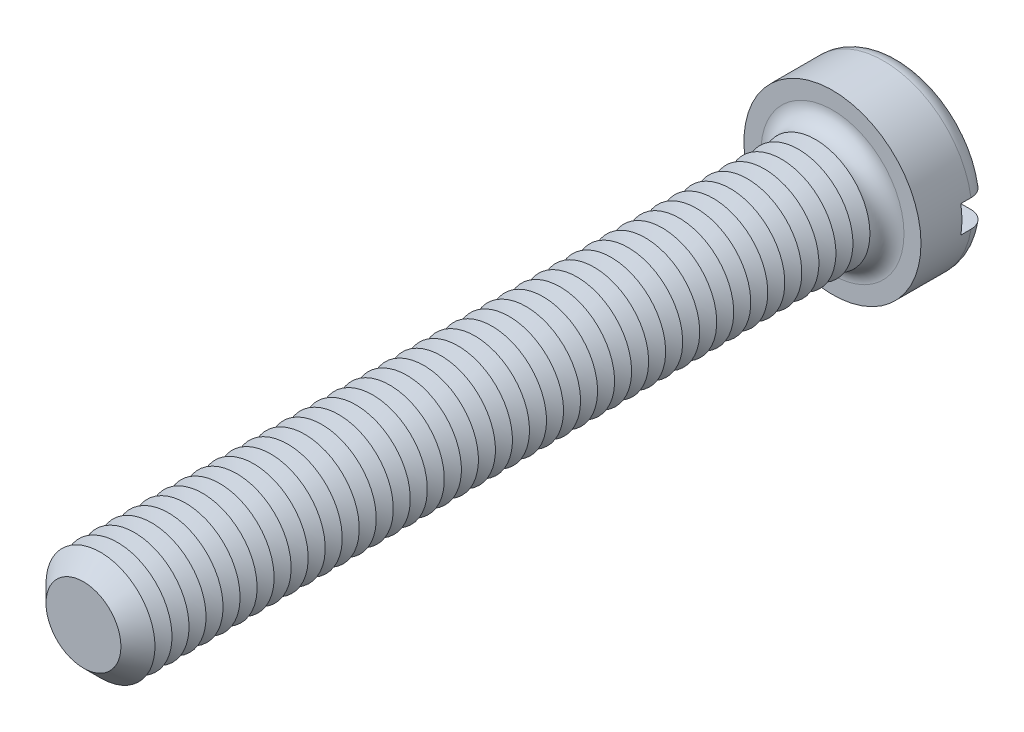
ISO-10303-21;
HEADER;
FILE_DESCRIPTION(('STEP AP214'),'2;1');
FILE_NAME('part.step','',(''),(''),'','','');
FILE_SCHEMA(('AUTOMOTIVE_DESIGN { 1 0 10303 214 1 1 1 1 }'));
ENDSEC;
DATA;
#1=APPLICATION_CONTEXT('core data for automotive mechanical design processes');
#2=APPLICATION_PROTOCOL_DEFINITION('international standard','automotive_design',2000,#1);
#3=PRODUCT_CONTEXT('',#1,'mechanical');
#4=PRODUCT('Part','Part','',(#3));
#5=PRODUCT_RELATED_PRODUCT_CATEGORY('part','',(#4));
#6=PRODUCT_DEFINITION_FORMATION('','',#4);
#7=PRODUCT_DEFINITION_CONTEXT('part definition',#1,'design');
#8=PRODUCT_DEFINITION('design','',#6,#7);
#9=PRODUCT_DEFINITION_SHAPE('','',#8);
#10=(LENGTH_UNIT() NAMED_UNIT(*) SI_UNIT(.MILLI.,.METRE.));
#11=(NAMED_UNIT(*) PLANE_ANGLE_UNIT() SI_UNIT($,.RADIAN.));
#12=(NAMED_UNIT(*) SI_UNIT($,.STERADIAN.) SOLID_ANGLE_UNIT());
#13=UNCERTAINTY_MEASURE_WITH_UNIT(LENGTH_MEASURE(1.E-05),#10,'distance_accuracy_value','');
#14=(GEOMETRIC_REPRESENTATION_CONTEXT(3) GLOBAL_UNCERTAINTY_ASSIGNED_CONTEXT((#13)) GLOBAL_UNIT_ASSIGNED_CONTEXT((#10,
#11,#12)) REPRESENTATION_CONTEXT('',''));
#15=CARTESIAN_POINT('',(0.,0.,0.));
#16=DIRECTION('',(0.,0.,1.));
#17=DIRECTION('',(1.,0.,0.));
#18=AXIS2_PLACEMENT_3D('',#15,#16,#17);
#19=CARTESIAN_POINT('',(0.,0.,-5.));
#20=DIRECTION('',(0.,0.,1.));
#21=DIRECTION('',(1.,0.,0.));
#22=AXIS2_PLACEMENT_3D('',#19,#20,#21);
#23=PLANE('',#22);
#24=CARTESIAN_POINT('',(0.,0.,-5.));
#25=DIRECTION('',(0.,0.,1.));
#26=DIRECTION('',(1.,0.,0.));
#27=AXIS2_PLACEMENT_3D('',#24,#25,#26);
#28=CIRCLE('',#27,5.25);
#29=CARTESIAN_POINT('',(-5.15388203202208,1.,-5.));
#30=VERTEX_POINT('',#29);
#31=CARTESIAN_POINT('',(5.15388203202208,1.,-5.));
#32=VERTEX_POINT('',#31);
#33=EDGE_CURVE('E116',#30,#32,#28,.F.);
#34=ORIENTED_EDGE('',*,*,#33,.T.);
#35=DIRECTION('',(1.,0.,0.));
#36=VECTOR('',#35,1.);
#37=CARTESIAN_POINT('',(-6.5,1.,-5.));
#38=LINE('',#37,#36);
#39=EDGE_CURVE('E111',#30,#32,#38,.T.);
#40=ORIENTED_EDGE('',*,*,#39,.F.);
#41=EDGE_LOOP('',(#34,#40));
#42=FACE_BOUND('',#41,.T.);
#43=ADVANCED_FACE('F39',(#42),#23,.F.);
#44=CARTESIAN_POINT('',(0.,0.,-3.75));
#45=DIRECTION('',(0.,0.,1.));
#46=DIRECTION('',(1.,0.,0.));
#47=AXIS2_PLACEMENT_3D('',#44,#45,#46);
#48=TOROIDAL_SURFACE('',#47,5.25,1.25);
#49=CARTESIAN_POINT('',(-6.04655789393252,1.,-4.63904490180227));
#50=CARTESIAN_POINT('',(-5.99546860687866,1.,-4.68885774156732));
#51=CARTESIAN_POINT('',(-5.94008472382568,1.,-4.73434760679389));
#52=CARTESIAN_POINT('',(-5.8223927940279,1.,-4.81538052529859));
#53=CARTESIAN_POINT('',(-5.7600753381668,1.,-4.85090982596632));
#54=CARTESIAN_POINT('',(-5.63044351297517,1.,-4.91100606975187));
#55=CARTESIAN_POINT('',(-5.56313479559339,1.,-4.93558519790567));
#56=CARTESIAN_POINT('',(-5.42539577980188,1.,-4.97322457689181));
#57=CARTESIAN_POINT('',(-5.35496625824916,1.,-4.98628767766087));
#58=CARTESIAN_POINT('',(-5.21212635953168,1.,-5.00070478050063));
#59=CARTESIAN_POINT('',(-5.13970265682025,1.,-5.00192674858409));
#60=CARTESIAN_POINT('',(-4.99565121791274,1.,-4.99234085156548));
#61=CARTESIAN_POINT('',(-4.92402357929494,1.,-4.98153152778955));
#62=CARTESIAN_POINT('',(-4.78274786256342,1.,-4.94801424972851));
#63=CARTESIAN_POINT('',(-4.71313137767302,1.,-4.92517296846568));
#64=CARTESIAN_POINT('',(-4.57871041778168,1.,-4.86813760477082));
#65=CARTESIAN_POINT('',(-4.51390612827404,1.,-4.83394308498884));
#66=CARTESIAN_POINT('',(-4.39095493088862,1.,-4.75508341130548));
#67=CARTESIAN_POINT('',(-4.33281197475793,1.,-4.7104120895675));
#68=CARTESIAN_POINT('',(-4.22499800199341,1.,-4.61179869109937));
#69=CARTESIAN_POINT('',(-4.17532640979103,1.,-4.55785724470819));
#70=CARTESIAN_POINT('',(-4.08677450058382,1.,-4.4431082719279));
#71=CARTESIAN_POINT('',(-4.0477350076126,1.,-4.38242369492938));
#72=CARTESIAN_POINT('',(-3.98074296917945,1.,-4.25521412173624));
#73=CARTESIAN_POINT('',(-3.95278836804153,1.,-4.18869021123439));
#74=CARTESIAN_POINT('',(-3.90959497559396,1.,-4.0537026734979));
#75=CARTESIAN_POINT('',(-3.89401985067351,1.,-3.98534663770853));
#76=CARTESIAN_POINT('',(-3.8748586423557,1.,-3.84697740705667));
#77=CARTESIAN_POINT('',(-3.87127067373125,1.,-3.7769644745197));
#78=CARTESIAN_POINT('',(-3.8761573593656,1.,-3.63892215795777));
#79=CARTESIAN_POINT('',(-3.88436651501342,1.,-3.57088319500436));
#80=CARTESIAN_POINT('',(-3.91207743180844,1.,-3.43714958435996));
#81=CARTESIAN_POINT('',(-3.93157911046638,1.,-3.37145491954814));
#82=CARTESIAN_POINT('',(-3.98125045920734,1.,-3.24411474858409));
#83=CARTESIAN_POINT('',(-4.01143761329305,1.,-3.18247607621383));
#84=CARTESIAN_POINT('',(-4.08150210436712,1.,-3.064981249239));
#85=CARTESIAN_POINT('',(-4.12138048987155,1.,-3.0091257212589));
#86=CARTESIAN_POINT('',(-4.2106718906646,1.,-2.90336353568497));
#87=CARTESIAN_POINT('',(-4.26028693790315,1.,-2.85362751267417));
#88=CARTESIAN_POINT('',(-4.36696587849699,1.,-2.76291710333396));
#89=CARTESIAN_POINT('',(-4.42403082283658,1.,-2.72194395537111));
#90=CARTESIAN_POINT('',(-4.54567957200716,1.,-2.64877280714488));
#91=CARTESIAN_POINT('',(-4.61042643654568,1.,-2.61684571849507));
#92=CARTESIAN_POINT('',(-4.74430563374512,1.,-2.56412359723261));
#93=CARTESIAN_POINT('',(-4.81343838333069,1.,-2.54332962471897));
#94=CARTESIAN_POINT('',(-4.95527237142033,1.,-2.51320471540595));
#95=CARTESIAN_POINT('',(-5.0280120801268,1.,-2.50405449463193));
#96=CARTESIAN_POINT('',(-5.17399775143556,1.,-2.49810126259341));
#97=CARTESIAN_POINT('',(-5.24724372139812,1.,-2.50129843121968));
#98=CARTESIAN_POINT('',(-5.3921014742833,1.,-2.52000776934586));
#99=CARTESIAN_POINT('',(-5.4637142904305,1.,-2.53551191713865));
#100=CARTESIAN_POINT('',(-5.60326680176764,1.,-2.57846304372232));
#101=CARTESIAN_POINT('',(-5.67120668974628,1.,-2.60590939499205));
#102=CARTESIAN_POINT('',(-5.80064060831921,1.,-2.67164926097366));
#103=CARTESIAN_POINT('',(-5.862199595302,1.,-2.7098148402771));
#104=CARTESIAN_POINT('',(-5.9779079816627,1.,-2.79608690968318));
#105=CARTESIAN_POINT('',(-6.03205795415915,1.,-2.84419263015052));
#106=CARTESIAN_POINT('',(-6.13055119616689,1.,-2.94820522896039));
#107=CARTESIAN_POINT('',(-6.17502887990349,1.,-3.00398483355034));
#108=CARTESIAN_POINT('',(-6.25384180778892,1.,-3.12230113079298));
#109=CARTESIAN_POINT('',(-6.28817779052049,1.,-3.18483733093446));
#110=CARTESIAN_POINT('',(-6.34527986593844,1.,-3.31401726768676));
#111=CARTESIAN_POINT('',(-6.36818984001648,1.,-3.38059742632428));
#112=CARTESIAN_POINT('',(-6.40240470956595,1.,-3.5166725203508));
#113=CARTESIAN_POINT('',(-6.41371067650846,1.,-3.58616718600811));
#114=CARTESIAN_POINT('',(-6.42433240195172,1.,-3.72550026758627));
#115=CARTESIAN_POINT('',(-6.4237441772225,1.,-3.79533138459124));
#116=CARTESIAN_POINT('',(-6.41082814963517,1.,-3.93391789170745));
#117=CARTESIAN_POINT('',(-6.39849757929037,1.,-4.00267302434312));
#118=CARTESIAN_POINT('',(-6.36249191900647,1.,-4.13704597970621));
#119=CARTESIAN_POINT('',(-6.33883072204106,1.,-4.20266753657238));
#120=CARTESIAN_POINT('',(-6.28088769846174,1.,-4.32897165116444));
#121=CARTESIAN_POINT('',(-6.24661890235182,1.,-4.38966015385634));
#122=CARTESIAN_POINT('',(-6.18404039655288,1.,-4.48163773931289));
#123=CARTESIAN_POINT('',(-6.15876600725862,1.,-4.51503333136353));
#124=CARTESIAN_POINT('',(-6.10500607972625,1.,-4.5791298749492));
#125=CARTESIAN_POINT('',(-6.07652056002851,1.,-4.60983084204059));
#126=CARTESIAN_POINT('',(-6.04655789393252,1.,-4.63904490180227));
#127=B_SPLINE_CURVE_WITH_KNOTS('',3,(#49,#50,#51,#52,#53,#54,#55,#56,#57,#58,#59,#60,#61,#62,
#63,#64,#65,#66,#67,#68,#69,#70,#71,#72,#73,#74,#75,#76,#77,#78,#79,#80,#81,#82,#83,#84,#85,#86,
#87,#88,#89,#90,#91,#92,#93,#94,#95,#96,#97,#98,#99,#100,#101,#102,#103,#104,#105,#106,#107,
#108,#109,#110,#111,#112,#113,#114,#115,#116,#117,#118,#119,#120,#121,#122,#123,#124,#125,#126),
.UNSPECIFIED.,.T.,.F.,(4,2,2,2,2,2,2,2,2,2,2,2,2,2,2,2,2,2,2,2,2,2,2,2,2,2,2,2,2,2,2,2,2,2,2,2,
2,2,4),(0.,0.213907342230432,0.428108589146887,0.642070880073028,0.855980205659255,
1.07227200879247,1.28859003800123,1.50735715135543,1.72613269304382,1.94503735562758,
2.16392713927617,2.37933295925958,2.59469881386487,2.80399176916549,3.01325180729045,
3.2178754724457,3.42249764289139,3.62745618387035,3.83243690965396,4.04223444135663,
4.25206160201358,4.46763253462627,4.68322399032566,4.90212226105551,5.12102372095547,
5.33978261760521,5.55853002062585,5.77477015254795,5.99099354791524,6.20398686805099,
6.41696467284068,6.62718821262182,6.83739233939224,7.0459002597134,7.25445733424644,
7.46275934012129,7.67080647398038,7.79625882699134,7.92171045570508),.UNSPECIFIED.);
#128=CARTESIAN_POINT('',(-6.42261628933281,1.,-3.74999999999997));
#129=VERTEX_POINT('',#128);
#130=EDGE_CURVE('E515',#129,#30,#127,.T.);
#131=ORIENTED_EDGE('',*,*,#130,.F.);
#132=CARTESIAN_POINT('',(0.,0.,-3.75));
#133=DIRECTION('',(0.,0.,1.));
#134=DIRECTION('',(1.,0.,0.));
#135=AXIS2_PLACEMENT_3D('',#132,#133,#134);
#136=CIRCLE('',#135,6.5);
#137=CARTESIAN_POINT('',(6.42261628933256,1.,-3.75));
#138=VERTEX_POINT('',#137);
#139=EDGE_CURVE('E125',#138,#129,#136,.T.);
#140=ORIENTED_EDGE('',*,*,#139,.F.);
#141=CARTESIAN_POINT('',(4.06944999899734,1.,-4.4133199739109));
#142=CARTESIAN_POINT('',(4.10828271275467,1.,-4.47354709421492));
#143=CARTESIAN_POINT('',(4.15233880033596,1.,-4.53047894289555));
#144=CARTESIAN_POINT('',(4.24946916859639,1.,-4.63614530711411));
#145=CARTESIAN_POINT('',(4.3025574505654,1.,-4.68486685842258));
#146=CARTESIAN_POINT('',(4.41603250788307,1.,-4.77271114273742));
#147=CARTESIAN_POINT('',(4.47640839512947,1.,-4.8118479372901));
#148=CARTESIAN_POINT('',(4.60277035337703,1.,-4.87959878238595));
#149=CARTESIAN_POINT('',(4.66875480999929,1.,-4.90821584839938));
#150=CARTESIAN_POINT('',(4.80558589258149,1.,-4.95456537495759));
#151=CARTESIAN_POINT('',(4.87649196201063,1.,-4.97212253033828));
#152=CARTESIAN_POINT('',(5.02024710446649,1.,-4.99514979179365));
#153=CARTESIAN_POINT('',(5.09309636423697,1.,-5.00061873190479));
#154=CARTESIAN_POINT('',(5.23902872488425,1.,-4.99926689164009));
#155=CARTESIAN_POINT('',(5.31211131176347,1.,-4.99238812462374));
#156=CARTESIAN_POINT('',(5.45605806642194,1.,-4.96635140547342));
#157=CARTESIAN_POINT('',(5.52692231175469,1.,-4.94719388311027));
#158=CARTESIAN_POINT('',(5.66376170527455,1.,-4.89728421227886));
#159=CARTESIAN_POINT('',(5.72977335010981,1.,-4.86663219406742));
#160=CARTESIAN_POINT('',(5.85560715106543,1.,-4.79452334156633));
#161=CARTESIAN_POINT('',(5.91542977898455,1.,-4.7530673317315));
#162=CARTESIAN_POINT('',(6.02626022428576,1.,-4.66116821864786));
#163=CARTESIAN_POINT('',(6.07738307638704,1.,-4.6108638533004));
#164=CARTESIAN_POINT('',(6.17030947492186,1.,-4.50227823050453));
#165=CARTESIAN_POINT('',(6.2121137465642,1.,-4.44399759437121));
#166=CARTESIAN_POINT('',(6.28460268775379,1.,-4.32200305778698));
#167=CARTESIAN_POINT('',(6.31543589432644,1.,-4.2583773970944));
#168=CARTESIAN_POINT('',(6.36586009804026,1.,-4.12681721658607));
#169=CARTESIAN_POINT('',(6.38545178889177,1.,-4.0588829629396));
#170=CARTESIAN_POINT('',(6.41265760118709,1.,-3.92136007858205));
#171=CARTESIAN_POINT('',(6.42038873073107,1.,-3.85179457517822));
#172=CARTESIAN_POINT('',(6.42401070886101,1.,-3.7123569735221));
#173=CARTESIAN_POINT('',(6.41990193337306,1.,-3.64248488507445));
#174=CARTESIAN_POINT('',(6.40000894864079,1.,-3.50470871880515));
#175=CARTESIAN_POINT('',(6.38427119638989,1.,-3.43679792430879));
#176=CARTESIAN_POINT('',(6.34164491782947,1.,-3.30457296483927));
#177=CARTESIAN_POINT('',(6.31475638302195,1.,-3.24025880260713));
#178=CARTESIAN_POINT('',(6.2505455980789,1.,-3.11686791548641));
#179=CARTESIAN_POINT('',(6.21319759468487,1.,-3.05780459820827));
#180=CARTESIAN_POINT('',(6.12919411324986,1.,-2.94671919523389));
#181=CARTESIAN_POINT('',(6.08253833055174,1.,-2.89469734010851));
#182=CARTESIAN_POINT('',(5.98083387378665,1.,-2.79868150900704));
#183=CARTESIAN_POINT('',(5.92571704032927,1.,-2.75475975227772));
#184=CARTESIAN_POINT('',(5.80897194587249,1.,-2.67665277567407));
#185=CARTESIAN_POINT('',(5.74734329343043,1.,-2.64246814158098));
#186=CARTESIAN_POINT('',(5.6184644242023,1.,-2.58431810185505));
#187=CARTESIAN_POINT('',(5.55115102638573,1.,-2.56049275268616));
#188=CARTESIAN_POINT('',(5.41351272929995,1.,-2.52429868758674));
#189=CARTESIAN_POINT('',(5.34318759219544,1.,-2.51193087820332));
#190=CARTESIAN_POINT('',(5.20041507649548,1.,-2.49882112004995));
#191=CARTESIAN_POINT('',(5.12795169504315,1.,-2.49825332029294));
#192=CARTESIAN_POINT('',(4.98393373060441,1.,-2.50914771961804));
#193=CARTESIAN_POINT('',(4.91237921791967,1.,-2.52061084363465));
#194=CARTESIAN_POINT('',(4.77137358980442,1.,-2.55542281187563));
#195=CARTESIAN_POINT('',(4.70195472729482,1.,-2.57890245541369));
#196=CARTESIAN_POINT('',(4.56803538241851,1.,-2.63717701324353));
#197=CARTESIAN_POINT('',(4.50353509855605,1.,-2.67197238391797));
#198=CARTESIAN_POINT('',(4.38131858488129,1.,-2.7519648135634));
#199=CARTESIAN_POINT('',(4.32360365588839,1.,-2.79716386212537));
#200=CARTESIAN_POINT('',(4.21673400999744,1.,-2.89675634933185));
#201=CARTESIAN_POINT('',(4.16757871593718,1.,-2.95114916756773));
#202=CARTESIAN_POINT('',(4.08014713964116,1.,-3.06667703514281));
#203=CARTESIAN_POINT('',(4.04170608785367,1.,-3.12768727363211));
#204=CARTESIAN_POINT('',(3.97596192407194,1.,-3.25543782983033));
#205=CARTESIAN_POINT('',(3.94865624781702,1.,-3.32217682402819));
#206=CARTESIAN_POINT('',(3.9067737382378,1.,-3.45745603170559));
#207=CARTESIAN_POINT('',(3.89185707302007,1.,-3.52589108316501));
#208=CARTESIAN_POINT('',(3.87400755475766,1.,-3.66432360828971));
#209=CARTESIAN_POINT('',(3.87107601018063,1.,-3.73432125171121));
#210=CARTESIAN_POINT('',(3.8772387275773,1.,-3.87228267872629));
#211=CARTESIAN_POINT('',(3.88607933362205,1.,-3.94025811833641));
#212=CARTESIAN_POINT('',(3.91502769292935,1.,-4.07370133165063));
#213=CARTESIAN_POINT('',(3.93512131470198,1.,-4.1391721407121));
#214=CARTESIAN_POINT('',(3.9752037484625,1.,-4.23926719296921));
#215=CARTESIAN_POINT('',(3.99171171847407,1.,-4.27532618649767));
#216=CARTESIAN_POINT('',(4.02809737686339,1.,-4.34569933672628));
#217=CARTESIAN_POINT('',(4.04797497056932,1.,-4.3800135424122));
#218=CARTESIAN_POINT('',(4.06944999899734,1.,-4.4133199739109));
#219=B_SPLINE_CURVE_WITH_KNOTS('',3,(#141,#142,#143,#144,#145,#146,#147,#148,#149,#150,#151,
#152,#153,#154,#155,#156,#157,#158,#159,#160,#161,#162,#163,#164,#165,#166,#167,#168,#169,#170,
#171,#172,#173,#174,#175,#176,#177,#178,#179,#180,#181,#182,#183,#184,#185,#186,#187,#188,#189,
#190,#191,#192,#193,#194,#195,#196,#197,#198,#199,#200,#201,#202,#203,#204,#205,#206,#207,#208,
#209,#210,#211,#212,#213,#214,#215,#216,#217,#218),.UNSPECIFIED.,.T.,.F.,(4,2,2,2,2,2,2,2,2,2,2,
2,2,2,2,2,2,2,2,2,2,2,2,2,2,2,2,2,2,2,2,2,2,2,2,2,2,2,4),(0.,0.214833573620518,
0.430003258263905,0.644855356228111,0.859645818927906,1.0777603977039,1.29589601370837,
1.51505870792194,1.73421373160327,1.95150241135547,2.16877451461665,2.38290237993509,
2.59701357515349,2.8081044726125,3.01918234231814,3.22816416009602,3.43713934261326,
3.64528416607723,3.85342914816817,4.06209119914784,4.27076008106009,4.48120788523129,
4.69166834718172,4.90489186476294,5.11813225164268,5.33451752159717,5.55091942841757,
5.76972860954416,5.98854661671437,6.20740650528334,6.42625163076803,6.64151774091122,
6.85673425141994,7.0658317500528,7.27495207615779,7.47963858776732,7.68406862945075,
7.80287790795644,7.92168384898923),.UNSPECIFIED.);
#220=EDGE_CURVE('E517',#32,#138,#219,.T.);
#221=ORIENTED_EDGE('',*,*,#220,.F.);
#222=ORIENTED_EDGE('',*,*,#33,.F.);
#223=EDGE_LOOP('',(#131,#140,#221,#222));
#224=FACE_BOUND('',#223,.T.);
#225=ADVANCED_FACE('F499',(#224),#48,.T.);
#226=CARTESIAN_POINT('',(0.,0.,-5.));
#227=DIRECTION('',(0.,0.,1.));
#228=DIRECTION('',(1.,0.,0.));
#229=AXIS2_PLACEMENT_3D('',#226,#227,#228);
#230=CYLINDRICAL_SURFACE('',#229,6.5);
#231=DIRECTION('',(0.,0.,1.));
#232=VECTOR('',#231,1.);
#233=CARTESIAN_POINT('',(6.42261628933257,1.,-5.));
#234=LINE('',#233,#232);
#235=CARTESIAN_POINT('',(6.42261628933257,1.,-3.));
#236=VERTEX_POINT('',#235);
#237=EDGE_CURVE('E530',#138,#236,#234,.T.);
#238=ORIENTED_EDGE('',*,*,#237,.F.);
#239=ORIENTED_EDGE('',*,*,#139,.T.);
#240=DIRECTION('',(0.,0.,1.));
#241=VECTOR('',#240,1.);
#242=CARTESIAN_POINT('',(-6.42261628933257,1.,-5.));
#243=LINE('',#242,#241);
#244=CARTESIAN_POINT('',(-6.42261628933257,1.,-3.));
#245=VERTEX_POINT('',#244);
#246=EDGE_CURVE('E63',#245,#129,#243,.F.);
#247=ORIENTED_EDGE('',*,*,#246,.F.);
#248=CARTESIAN_POINT('',(0.,0.,-3.));
#249=DIRECTION('',(0.,0.,-1.));
#250=DIRECTION('',(-1.,0.,0.));
#251=AXIS2_PLACEMENT_3D('',#248,#249,#250);
#252=CIRCLE('',#251,6.5);
#253=CARTESIAN_POINT('',(-6.42261628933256,-0.999999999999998,-3.));
#254=VERTEX_POINT('',#253);
#255=EDGE_CURVE('E43',#245,#254,#252,.F.);
#256=ORIENTED_EDGE('',*,*,#255,.T.);
#257=DIRECTION('',(0.,0.,1.));
#258=VECTOR('',#257,1.);
#259=CARTESIAN_POINT('',(-6.42261628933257,-0.999999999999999,-5.));
#260=LINE('',#259,#258);
#261=CARTESIAN_POINT('',(-6.42261628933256,-0.999999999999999,-3.75));
#262=VERTEX_POINT('',#261);
#263=EDGE_CURVE('E527',#262,#254,#260,.T.);
#264=ORIENTED_EDGE('',*,*,#263,.F.);
#265=CARTESIAN_POINT('',(6.42261628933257,-1.,-3.75));
#266=VERTEX_POINT('',#265);
#267=EDGE_CURVE('E127',#262,#266,#136,.T.);
#268=ORIENTED_EDGE('',*,*,#267,.T.);
#269=DIRECTION('',(0.,0.,1.));
#270=VECTOR('',#269,1.);
#271=CARTESIAN_POINT('',(6.42261628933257,-1.,-5.));
#272=LINE('',#271,#270);
#273=CARTESIAN_POINT('',(6.42261628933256,-1.,-3.));
#274=VERTEX_POINT('',#273);
#275=EDGE_CURVE('E55',#274,#266,#272,.F.);
#276=ORIENTED_EDGE('',*,*,#275,.F.);
#277=EDGE_CURVE('E11',#274,#236,#252,.F.);
#278=ORIENTED_EDGE('',*,*,#277,.T.);
#279=EDGE_LOOP('',(#238,#239,#247,#256,#264,#268,#276,#278));
#280=FACE_BOUND('',#279,.T.);
#281=CARTESIAN_POINT('',(0.,0.,0.));
#282=DIRECTION('',(0.,0.,1.));
#283=DIRECTION('',(1.,0.,0.));
#284=AXIS2_PLACEMENT_3D('',#281,#282,#283);
#285=CIRCLE('',#284,6.5);
#286=CARTESIAN_POINT('',(6.5,0.,0.));
#287=VERTEX_POINT('',#286);
#288=EDGE_CURVE('E533',#287,#287,#285,.T.);
#289=ORIENTED_EDGE('',*,*,#288,.F.);
#290=EDGE_LOOP('',(#289));
#291=FACE_BOUND('',#290,.T.);
#292=ADVANCED_FACE('F495',(#280,#291),#230,.T.);
#293=CARTESIAN_POINT('',(5.15388203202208,-1.,-5.));
#294=VERTEX_POINT('',#293);
#295=CARTESIAN_POINT('',(-5.15388203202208,-0.999999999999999,-5.));
#296=VERTEX_POINT('',#295);
#297=EDGE_CURVE('E109',#294,#296,#28,.F.);
#298=ORIENTED_EDGE('',*,*,#297,.T.);
#299=DIRECTION('',(-1.,0.,0.));
#300=VECTOR('',#299,1.);
#301=CARTESIAN_POINT('',(-6.5,-0.999999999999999,-5.));
#302=LINE('',#301,#300);
#303=EDGE_CURVE('E96',#294,#296,#302,.T.);
#304=ORIENTED_EDGE('',*,*,#303,.F.);
#305=EDGE_LOOP('',(#298,#304));
#306=FACE_BOUND('',#305,.T.);
#307=ADVANCED_FACE('F108',(#306),#23,.F.);
#308=CARTESIAN_POINT('',(0.,0.,0.));
#309=DIRECTION('',(0.,0.,1.));
#310=DIRECTION('',(1.,0.,0.));
#311=AXIS2_PLACEMENT_3D('',#308,#309,#310);
#312=PLANE('',#311);
#313=CARTESIAN_POINT('',(0.,0.,0.));
#314=DIRECTION('',(0.,0.,1.));
#315=DIRECTION('',(1.,0.,0.));
#316=AXIS2_PLACEMENT_3D('',#313,#314,#315);
#317=CIRCLE('',#316,5.25);
#318=CARTESIAN_POINT('',(5.25,0.,0.));
#319=VERTEX_POINT('',#318);
#320=EDGE_CURVE('E115',#319,#319,#317,.F.);
#321=ORIENTED_EDGE('',*,*,#320,.T.);
#322=EDGE_LOOP('',(#321));
#323=FACE_BOUND('',#322,.T.);
#324=ORIENTED_EDGE('',*,*,#288,.T.);
#325=EDGE_LOOP('',(#324));
#326=FACE_BOUND('',#325,.T.);
#327=ADVANCED_FACE('F494',(#323,#326),#312,.T.);
#328=CARTESIAN_POINT('',(-6.04655789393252,-0.999999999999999,-4.63904490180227));
#329=CARTESIAN_POINT('',(-6.0966604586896,-0.999999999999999,-4.59018532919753));
#330=CARTESIAN_POINT('',(-6.14270501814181,-0.999999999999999,-4.53709744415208));
#331=CARTESIAN_POINT('',(-6.22528519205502,-0.999999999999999,-4.42391631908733));
#332=CARTESIAN_POINT('',(-6.26181074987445,-0.999999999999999,-4.36381576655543));
#333=CARTESIAN_POINT('',(-6.32422109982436,-0.999999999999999,-4.23831836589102));
#334=CARTESIAN_POINT('',(-6.35010658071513,-0.999999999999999,-4.17292186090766));
#335=CARTESIAN_POINT('',(-6.39044668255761,-0.999999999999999,-4.03870925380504));
#336=CARTESIAN_POINT('',(-6.40490396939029,-0.999999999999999,-3.96989395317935));
#337=CARTESIAN_POINT('',(-6.42190814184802,-0.999999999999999,-3.83122595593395));
#338=CARTESIAN_POINT('',(-6.4245257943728,-0.999999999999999,-3.76138193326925));
#339=CARTESIAN_POINT('',(-6.41796432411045,-0.999999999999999,-3.62224935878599));
#340=CARTESIAN_POINT('',(-6.40878509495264,-0.999999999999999,-3.55296081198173));
#341=CARTESIAN_POINT('',(-6.37894560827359,-0.999999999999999,-3.41709241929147));
#342=CARTESIAN_POINT('',(-6.35831520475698,-0.999999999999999,-3.35050601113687));
#343=CARTESIAN_POINT('',(-6.30620980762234,-0.999999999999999,-3.22172312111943));
#344=CARTESIAN_POINT('',(-6.2747347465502,-0.999999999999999,-3.15952666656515));
#345=CARTESIAN_POINT('',(-6.20172710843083,-0.999999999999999,-3.04101762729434));
#346=CARTESIAN_POINT('',(-6.16015622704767,-0.999999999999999,-2.98472864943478));
#347=CARTESIAN_POINT('',(-6.06823774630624,-0.999999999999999,-2.87984578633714));
#348=CARTESIAN_POINT('',(-6.01788981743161,-0.999999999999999,-2.83125219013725));
#349=CARTESIAN_POINT('',(-5.90933830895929,-0.999999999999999,-2.74262118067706));
#350=CARTESIAN_POINT('',(-5.85106338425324,-0.999999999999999,-2.70267117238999));
#351=CARTESIAN_POINT('',(-5.72870702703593,-0.999999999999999,-2.63296796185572));
#352=CARTESIAN_POINT('',(-5.66462521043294,-0.999999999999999,-2.6032154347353));
#353=CARTESIAN_POINT('',(-5.53153273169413,-0.999999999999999,-2.55430842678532));
#354=CARTESIAN_POINT('',(-5.46246626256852,-0.999999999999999,-2.53530583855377));
#355=CARTESIAN_POINT('',(-5.32214267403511,-0.999999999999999,-2.5089831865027));
#356=CARTESIAN_POINT('',(-5.25088537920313,-0.999999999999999,-2.50166406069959));
#357=CARTESIAN_POINT('',(-5.10710123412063,-0.999999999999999,-2.49882202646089));
#358=CARTESIAN_POINT('',(-5.03457095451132,-0.999999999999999,-2.50347166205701));
#359=CARTESIAN_POINT('',(-4.8912897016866,-0.999999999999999,-2.52476029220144));
#360=CARTESIAN_POINT('',(-4.82053886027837,-0.999999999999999,-2.54140017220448));
#361=CARTESIAN_POINT('',(-4.68213257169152,-0.999999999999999,-2.58641614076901));
#362=CARTESIAN_POINT('',(-4.61451256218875,-0.999999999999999,-2.61490131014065));
#363=CARTESIAN_POINT('',(-4.48502801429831,-0.999999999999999,-2.68285095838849));
#364=CARTESIAN_POINT('',(-4.42316359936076,-0.999999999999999,-2.72231567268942));
#365=CARTESIAN_POINT('',(-4.30720694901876,-0.999999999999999,-2.81103994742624));
#366=CARTESIAN_POINT('',(-4.25309118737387,-0.999999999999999,-2.86026872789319));
#367=CARTESIAN_POINT('',(-4.15409408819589,-0.999999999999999,-2.9672764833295));
#368=CARTESIAN_POINT('',(-4.10921182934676,-0.999999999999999,-3.02505460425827));
#369=CARTESIAN_POINT('',(-4.03096584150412,-0.999999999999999,-3.14632492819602));
#370=CARTESIAN_POINT('',(-3.99739097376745,-0.999999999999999,-3.2096807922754));
#371=CARTESIAN_POINT('',(-3.94171839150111,-0.999999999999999,-3.34124912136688));
#372=CARTESIAN_POINT('',(-3.91961840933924,-0.999999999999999,-3.40946062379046));
#373=CARTESIAN_POINT('',(-3.88816636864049,-0.999999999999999,-3.54669256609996));
#374=CARTESIAN_POINT('',(-3.87846562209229,-0.999999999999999,-3.61563318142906));
#375=CARTESIAN_POINT('',(-3.87100568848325,-0.999999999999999,-3.75415397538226));
#376=CARTESIAN_POINT('',(-3.87324501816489,-0.999999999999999,-3.82373407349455));
#377=CARTESIAN_POINT('',(-3.88943589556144,-0.999999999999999,-3.96027701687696));
#378=CARTESIAN_POINT('',(-3.90318225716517,-0.999999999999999,-4.0272643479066));
#379=CARTESIAN_POINT('',(-3.94163954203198,-0.999999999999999,-4.1580093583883));
#380=CARTESIAN_POINT('',(-3.96635075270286,-0.999999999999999,-4.22176695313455));
#381=CARTESIAN_POINT('',(-4.026160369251,-0.999999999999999,-4.34483320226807));
#382=CARTESIAN_POINT('',(-4.06134035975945,-0.999999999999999,-4.40410214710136));
#383=CARTESIAN_POINT('',(-4.14090865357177,-0.999999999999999,-4.51609417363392));
#384=CARTESIAN_POINT('',(-4.18529811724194,-0.999999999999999,-4.56881642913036));
#385=CARTESIAN_POINT('',(-4.2832649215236,-0.999999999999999,-4.66770177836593));
#386=CARTESIAN_POINT('',(-4.33705327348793,-0.999999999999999,-4.71365579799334));
#387=CARTESIAN_POINT('',(-4.45141776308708,-0.999999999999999,-4.79615385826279));
#388=CARTESIAN_POINT('',(-4.51199483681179,-0.999999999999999,-4.83269659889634));
#389=CARTESIAN_POINT('',(-4.63989216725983,-0.999999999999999,-4.89626962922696));
#390=CARTESIAN_POINT('',(-4.70734508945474,-0.999999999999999,-4.92303326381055));
#391=CARTESIAN_POINT('',(-4.84575497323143,-0.999999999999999,-4.96500199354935));
#392=CARTESIAN_POINT('',(-4.91671207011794,-0.999999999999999,-4.98020664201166));
#393=CARTESIAN_POINT('',(-5.06097761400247,-0.999999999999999,-4.9987306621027));
#394=CARTESIAN_POINT('',(-5.13430353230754,-0.999999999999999,-5.00191441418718));
#395=CARTESIAN_POINT('',(-5.28046546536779,-0.999999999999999,-4.99587686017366));
#396=CARTESIAN_POINT('',(-5.35330135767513,-0.999999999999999,-4.98665256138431));
#397=CARTESIAN_POINT('',(-5.49610354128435,-0.999999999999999,-4.95604184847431));
#398=CARTESIAN_POINT('',(-5.56607890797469,-0.999999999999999,-4.93469772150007));
#399=CARTESIAN_POINT('',(-5.70131538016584,-0.999999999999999,-4.88041956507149));
#400=CARTESIAN_POINT('',(-5.76658233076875,-0.999999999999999,-4.84750021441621));
#401=CARTESIAN_POINT('',(-5.86782577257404,-0.999999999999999,-4.78498748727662));
#402=CARTESIAN_POINT('',(-5.90579749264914,-0.999999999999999,-4.75856648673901));
#403=CARTESIAN_POINT('',(-5.97862186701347,-0.999999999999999,-4.70172646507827));
#404=CARTESIAN_POINT('',(-6.0134745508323,-0.999999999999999,-4.6713074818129));
#405=CARTESIAN_POINT('',(-6.04655789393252,-0.999999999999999,-4.63904490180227));
#406=B_SPLINE_CURVE_WITH_KNOTS('',3,(#328,#329,#330,#331,#332,#333,#334,#335,#336,#337,#338,
#339,#340,#341,#342,#343,#344,#345,#346,#347,#348,#349,#350,#351,#352,#353,#354,#355,#356,#357,
#358,#359,#360,#361,#362,#363,#364,#365,#366,#367,#368,#369,#370,#371,#372,#373,#374,#375,#376,
#377,#378,#379,#380,#381,#382,#383,#384,#385,#386,#387,#388,#389,#390,#391,#392,#393,#394,#395,
#396,#397,#398,#399,#400,#401,#402,#403,#404,#405),.UNSPECIFIED.,.T.,.F.,(4,2,2,2,2,2,2,2,2,2,2,
2,2,2,2,2,2,2,2,2,2,2,2,2,2,2,2,2,2,2,2,2,2,2,2,2,2,2,4),(0.,0.209780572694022,
0.419781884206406,0.629769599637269,0.839708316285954,1.04839053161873,1.2570746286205,
1.46521720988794,1.67336108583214,1.88230736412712,2.09126148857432,2.30223890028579,
2.51323027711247,2.72713284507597,2.94105258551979,3.15807345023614,3.37511034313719,
3.59419176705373,3.81327788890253,4.03168404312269,4.25006839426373,4.46411376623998,
4.67811682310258,4.88595885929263,5.09377507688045,5.29796268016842,5.50215563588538,
5.70798353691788,5.91383738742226,6.12510741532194,6.33640661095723,6.55309998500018,
6.76980173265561,6.98894112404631,7.20813337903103,7.42656551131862,7.64472163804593,
7.78324365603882,7.92176436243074),.UNSPECIFIED.);
#407=EDGE_CURVE('E103',#296,#262,#406,.T.);
#408=ORIENTED_EDGE('',*,*,#407,.F.);
#409=ORIENTED_EDGE('',*,*,#297,.F.);
#410=CARTESIAN_POINT('',(4.06944999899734,-1.,-4.4133199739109));
#411=CARTESIAN_POINT('',(4.03213207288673,-1.,-4.3554312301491));
#412=CARTESIAN_POINT('',(3.9995849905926,-1.,-4.29441722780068));
#413=CARTESIAN_POINT('',(3.94511822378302,-1.,-4.16776604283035));
#414=CARTESIAN_POINT('',(3.92320762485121,-1.,-4.10212496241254));
#415=CARTESIAN_POINT('',(3.89078811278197,-1.,-3.96804412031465));
#416=CARTESIAN_POINT('',(3.88028409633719,-1.,-3.89960316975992));
#417=CARTESIAN_POINT('',(3.87107895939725,-1.,-3.76194650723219));
#418=CARTESIAN_POINT('',(3.87237511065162,-1.,-3.69273097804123));
#419=CARTESIAN_POINT('',(3.88662927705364,-1.,-3.55634460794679));
#420=CARTESIAN_POINT('',(3.89944923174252,-1.,-3.48915926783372));
#421=CARTESIAN_POINT('',(3.93611188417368,-1.,-3.35786953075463));
#422=CARTESIAN_POINT('',(3.95995518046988,-1.,-3.29376530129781));
#423=CARTESIAN_POINT('',(4.0180748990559,-1.,-3.16993562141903));
#424=CARTESIAN_POINT('',(4.05242297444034,-1.,-3.11024385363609));
#425=CARTESIAN_POINT('',(4.13041121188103,-1.,-2.9972793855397));
#426=CARTESIAN_POINT('',(4.17405248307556,-1.,-2.94400745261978));
#427=CARTESIAN_POINT('',(4.27058636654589,-1.,-2.8439150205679));
#428=CARTESIAN_POINT('',(4.32368948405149,-1.,-2.79729757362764));
#429=CARTESIAN_POINT('',(4.43679856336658,-1.,-2.71336600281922));
#430=CARTESIAN_POINT('',(4.49680546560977,-1.,-2.67605314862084));
#431=CARTESIAN_POINT('',(4.62370121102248,-1.,-2.61081752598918));
#432=CARTESIAN_POINT('',(4.69072799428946,-1.,-2.58316284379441));
#433=CARTESIAN_POINT('',(4.82843981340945,-1.,-2.5393441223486));
#434=CARTESIAN_POINT('',(4.899125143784,-1.,-2.52318100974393));
#435=CARTESIAN_POINT('',(5.04306377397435,-1.,-2.50267755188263));
#436=CARTESIAN_POINT('',(5.11633773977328,-1.,-2.49848181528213));
#437=CARTESIAN_POINT('',(5.26254809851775,-1.,-2.50249357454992));
#438=CARTESIAN_POINT('',(5.33548449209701,-1.,-2.51070104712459));
#439=CARTESIAN_POINT('',(5.4786703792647,-1.,-2.53930888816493));
#440=CARTESIAN_POINT('',(5.54892819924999,-1.,-2.5596675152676));
#441=CARTESIAN_POINT('',(5.68495799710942,-1.,-2.61204238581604));
#442=CARTESIAN_POINT('',(5.75073024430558,-1.,-2.64405792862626));
#443=CARTESIAN_POINT('',(5.8750178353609,-1.,-2.7184150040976));
#444=CARTESIAN_POINT('',(5.93361487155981,-1.,-2.76061995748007));
#445=CARTESIAN_POINT('',(6.04275377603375,-1.,-2.85440601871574));
#446=CARTESIAN_POINT('',(6.09329629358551,-1.,-2.90598637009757));
#447=CARTESIAN_POINT('',(6.18409572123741,-1.,-3.01622977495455));
#448=CARTESIAN_POINT('',(6.2244945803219,-1.,-3.07477592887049));
#449=CARTESIAN_POINT('',(6.29474798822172,-1.,-3.19788594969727));
#450=CARTESIAN_POINT('',(6.3246032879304,-1.,-3.26244938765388));
#451=CARTESIAN_POINT('',(6.37256001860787,-1.,-3.39491634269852));
#452=CARTESIAN_POINT('',(6.39079949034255,-1.,-3.46276990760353));
#453=CARTESIAN_POINT('',(6.41554133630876,-1.,-3.60058363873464));
#454=CARTESIAN_POINT('',(6.42204424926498,-1.,-3.67054370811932));
#455=CARTESIAN_POINT('',(6.42311237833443,-1.,-3.81007982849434));
#456=CARTESIAN_POINT('',(6.41775799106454,-1.,-3.879655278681));
#457=CARTESIAN_POINT('',(6.39543799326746,-1.,-4.01691664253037));
#458=CARTESIAN_POINT('',(6.3784725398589,-1.,-4.08460258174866));
#459=CARTESIAN_POINT('',(6.33344768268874,-1.,-4.21614537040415));
#460=CARTESIAN_POINT('',(6.30539273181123,-1.,-4.28000374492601));
#461=CARTESIAN_POINT('',(6.23902076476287,-1.,-4.40214140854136));
#462=CARTESIAN_POINT('',(6.20070356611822,-1.,-4.46042059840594));
#463=CARTESIAN_POINT('',(6.11467174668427,-1.,-4.5701315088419));
#464=CARTESIAN_POINT('',(6.06690270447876,-1.,-4.62152053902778));
#465=CARTESIAN_POINT('',(5.96350111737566,-1.,-4.715657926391));
#466=CARTESIAN_POINT('',(5.90786817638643,-1.,-4.75840584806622));
#467=CARTESIAN_POINT('',(5.78965380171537,-1.,-4.8345781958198));
#468=CARTESIAN_POINT('',(5.72700078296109,-1.,-4.86789149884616));
#469=CARTESIAN_POINT('',(5.59704977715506,-1.,-4.92369754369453));
#470=CARTESIAN_POINT('',(5.52975144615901,-1.,-4.94618948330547));
#471=CARTESIAN_POINT('',(5.39137621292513,-1.,-4.98006173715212));
#472=CARTESIAN_POINT('',(5.32025859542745,-1.,-4.99127571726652));
#473=CARTESIAN_POINT('',(5.17715081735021,-1.,-5.00177798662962));
#474=CARTESIAN_POINT('',(5.10516061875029,-1.,-5.00106575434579));
#475=CARTESIAN_POINT('',(4.96131924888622,-1.,-4.98769775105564));
#476=CARTESIAN_POINT('',(4.88948297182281,-1.,-4.97488146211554));
#477=CARTESIAN_POINT('',(4.74893184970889,-1.,-4.93744335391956));
#478=CARTESIAN_POINT('',(4.68021795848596,-1.,-4.91281795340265));
#479=CARTESIAN_POINT('',(4.54744428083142,-1.,-4.8522329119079));
#480=CARTESIAN_POINT('',(4.48341761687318,-1.,-4.81620070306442));
#481=CARTESIAN_POINT('',(4.36244497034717,-1.,-4.73383277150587));
#482=CARTESIAN_POINT('',(4.30549069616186,-1.,-4.68750929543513));
#483=CARTESIAN_POINT('',(4.21823158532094,-1.,-4.60311228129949));
#484=CARTESIAN_POINT('',(4.18544074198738,-1.,-4.56757118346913));
#485=CARTESIAN_POINT('',(4.12413461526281,-1.,-4.49297229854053));
#486=CARTESIAN_POINT('',(4.09561926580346,-1.,-4.45391456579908));
#487=CARTESIAN_POINT('',(4.06944999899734,-1.,-4.4133199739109));
#488=B_SPLINE_CURVE_WITH_KNOTS('',3,(#410,#411,#412,#413,#414,#415,#416,#417,#418,#419,#420,
#421,#422,#423,#424,#425,#426,#427,#428,#429,#430,#431,#432,#433,#434,#435,#436,#437,#438,#439,
#440,#441,#442,#443,#444,#445,#446,#447,#448,#449,#450,#451,#452,#453,#454,#455,#456,#457,#458,
#459,#460,#461,#462,#463,#464,#465,#466,#467,#468,#469,#470,#471,#472,#473,#474,#475,#476,#477,
#478,#479,#480,#481,#482,#483,#484,#485,#486,#487),.UNSPECIFIED.,.T.,.F.,(4,2,2,2,2,2,2,2,2,2,2,
2,2,2,2,2,2,2,2,2,2,2,2,2,2,2,2,2,2,2,2,2,2,2,2,2,2,2,4),(0.,0.206453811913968,0.4130836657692,
0.619802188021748,0.826472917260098,1.03070015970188,1.23493849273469,1.44060223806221,
1.64629054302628,1.85731119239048,2.06836062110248,2.28487349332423,2.5014038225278,
2.72053974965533,2.9396752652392,3.15806230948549,3.37643622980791,3.59203140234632,
3.80760918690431,4.01997696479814,4.23232961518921,4.44210913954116,4.65187903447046,
4.86023097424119,5.06858009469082,5.27684563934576,5.48511488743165,5.69462015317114,
5.90413597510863,6.11602561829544,6.32793096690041,6.54291770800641,6.75791385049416,
6.97580180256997,7.19375587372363,7.41312537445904,7.63223520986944,7.77701357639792,
7.92178970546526),.UNSPECIFIED.);
#489=EDGE_CURVE('E92',#266,#294,#488,.T.);
#490=ORIENTED_EDGE('',*,*,#489,.F.);
#491=ORIENTED_EDGE('',*,*,#267,.F.);
#492=EDGE_LOOP('',(#408,#409,#490,#491));
#493=FACE_BOUND('',#492,.T.);
#494=ADVANCED_FACE('F113',(#493),#48,.T.);
#495=CARTESIAN_POINT('',(0.,0.,1.25));
#496=DIRECTION('',(0.,0.,1.));
#497=DIRECTION('',(1.,0.,0.));
#498=AXIS2_PLACEMENT_3D('',#495,#496,#497);
#499=TOROIDAL_SURFACE('',#498,5.25,1.25);
#500=ORIENTED_EDGE('',*,*,#320,.F.);
#501=EDGE_LOOP('',(#500));
#502=FACE_BOUND('',#501,.T.);
#503=CARTESIAN_POINT('',(0.,0.,1.25));
#504=DIRECTION('',(0.,0.,-1.));
#505=DIRECTION('',(-1.,0.,0.));
#506=AXIS2_PLACEMENT_3D('',#503,#504,#505);
#507=CIRCLE('',#506,4.);
#508=CARTESIAN_POINT('',(-4.,0.,1.25));
#509=VERTEX_POINT('',#508);
#510=EDGE_CURVE('E538',#509,#509,#507,.T.);
#511=ORIENTED_EDGE('',*,*,#510,.T.);
#512=EDGE_LOOP('',(#511));
#513=FACE_BOUND('',#512,.T.);
#514=ADVANCED_FACE('F487',(#502,#513),#499,.F.);
#515=CARTESIAN_POINT('',(0.,0.,1.875));
#516=DIRECTION('',(0.,0.,-1.));
#517=DIRECTION('',(-1.,0.,0.));
#518=AXIS2_PLACEMENT_3D('',#515,#516,#517);
#519=CONICAL_SURFACE('',#518,2.91746824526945,1.0471975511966);
#520=ORIENTED_EDGE('',*,*,#510,.F.);
#521=EDGE_LOOP('',(#520));
#522=FACE_BOUND('',#521,.T.);
#523=CARTESIAN_POINT('',(0.,0.,1.875));
#524=DIRECTION('',(0.,0.,-1.));
#525=DIRECTION('',(-1.,0.,0.));
#526=AXIS2_PLACEMENT_3D('',#523,#524,#525);
#527=CIRCLE('',#526,2.91746824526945);
#528=CARTESIAN_POINT('',(-2.91746824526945,0.,1.875));
#529=VERTEX_POINT('',#528);
#530=EDGE_CURVE('E545',#529,#529,#527,.T.);
#531=ORIENTED_EDGE('',*,*,#530,.T.);
#532=EDGE_LOOP('',(#531));
#533=FACE_BOUND('',#532,.T.);
#534=ADVANCED_FACE('F483',(#522,#533),#519,.T.);
#535=CARTESIAN_POINT('',(0.,0.,2.5));
#536=DIRECTION('',(0.,0.,1.));
#537=DIRECTION('',(1.,0.,0.));
#538=AXIS2_PLACEMENT_3D('',#535,#536,#537);
#539=CONICAL_SURFACE('',#538,4.,1.0471975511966);
#540=ORIENTED_EDGE('',*,*,#530,.F.);
#541=EDGE_LOOP('',(#540));
#542=FACE_BOUND('',#541,.T.);
#543=CARTESIAN_POINT('',(0.,0.,2.5));
#544=DIRECTION('',(0.,0.,-1.));
#545=DIRECTION('',(-1.,0.,0.));
#546=AXIS2_PLACEMENT_3D('',#543,#544,#545);
#547=CIRCLE('',#546,4.);
#548=CARTESIAN_POINT('',(-4.,0.,2.5));
#549=VERTEX_POINT('',#548);
#550=EDGE_CURVE('E550',#549,#549,#547,.T.);
#551=ORIENTED_EDGE('',*,*,#550,.T.);
#552=EDGE_LOOP('',(#551));
#553=FACE_BOUND('',#552,.T.);
#554=ADVANCED_FACE('F479',(#542,#553),#539,.T.);
#555=CARTESIAN_POINT('',(0.,0.,3.125));
#556=DIRECTION('',(0.,0.,-1.));
#557=DIRECTION('',(-1.,0.,0.));
#558=AXIS2_PLACEMENT_3D('',#555,#556,#557);
#559=CONICAL_SURFACE('',#558,2.91746824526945,1.0471975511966);
#560=ORIENTED_EDGE('',*,*,#550,.F.);
#561=EDGE_LOOP('',(#560));
#562=FACE_BOUND('',#561,.T.);
#563=CARTESIAN_POINT('',(0.,0.,3.125));
#564=DIRECTION('',(0.,0.,-1.));
#565=DIRECTION('',(-1.,0.,0.));
#566=AXIS2_PLACEMENT_3D('',#563,#564,#565);
#567=CIRCLE('',#566,2.91746824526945);
#568=CARTESIAN_POINT('',(-2.91746824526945,0.,3.125));
#569=VERTEX_POINT('',#568);
#570=EDGE_CURVE('E554',#569,#569,#567,.T.);
#571=ORIENTED_EDGE('',*,*,#570,.T.);
#572=EDGE_LOOP('',(#571));
#573=FACE_BOUND('',#572,.T.);
#574=ADVANCED_FACE('F475',(#562,#573),#559,.T.);
#575=CARTESIAN_POINT('',(0.,0.,3.75));
#576=DIRECTION('',(0.,0.,1.));
#577=DIRECTION('',(1.,0.,0.));
#578=AXIS2_PLACEMENT_3D('',#575,#576,#577);
#579=CONICAL_SURFACE('',#578,4.,1.0471975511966);
#580=ORIENTED_EDGE('',*,*,#570,.F.);
#581=EDGE_LOOP('',(#580));
#582=FACE_BOUND('',#581,.T.);
#583=CARTESIAN_POINT('',(0.,0.,3.75));
#584=DIRECTION('',(0.,0.,-1.));
#585=DIRECTION('',(-1.,0.,0.));
#586=AXIS2_PLACEMENT_3D('',#583,#584,#585);
#587=CIRCLE('',#586,4.);
#588=CARTESIAN_POINT('',(-4.,0.,3.75));
#589=VERTEX_POINT('',#588);
#590=EDGE_CURVE('E558',#589,#589,#587,.T.);
#591=ORIENTED_EDGE('',*,*,#590,.T.);
#592=EDGE_LOOP('',(#591));
#593=FACE_BOUND('',#592,.T.);
#594=ADVANCED_FACE('F471',(#582,#593),#579,.T.);
#595=CARTESIAN_POINT('',(0.,0.,4.375));
#596=DIRECTION('',(0.,0.,-1.));
#597=DIRECTION('',(-1.,0.,0.));
#598=AXIS2_PLACEMENT_3D('',#595,#596,#597);
#599=CONICAL_SURFACE('',#598,2.91746824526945,1.0471975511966);
#600=ORIENTED_EDGE('',*,*,#590,.F.);
#601=EDGE_LOOP('',(#600));
#602=FACE_BOUND('',#601,.T.);
#603=CARTESIAN_POINT('',(0.,0.,4.375));
#604=DIRECTION('',(0.,0.,-1.));
#605=DIRECTION('',(-1.,0.,0.));
#606=AXIS2_PLACEMENT_3D('',#603,#604,#605);
#607=CIRCLE('',#606,2.91746824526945);
#608=CARTESIAN_POINT('',(-2.91746824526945,0.,4.375));
#609=VERTEX_POINT('',#608);
#610=EDGE_CURVE('E562',#609,#609,#607,.T.);
#611=ORIENTED_EDGE('',*,*,#610,.T.);
#612=EDGE_LOOP('',(#611));
#613=FACE_BOUND('',#612,.T.);
#614=ADVANCED_FACE('F467',(#602,#613),#599,.T.);
#615=CARTESIAN_POINT('',(0.,0.,5.));
#616=DIRECTION('',(0.,0.,1.));
#617=DIRECTION('',(1.,0.,0.));
#618=AXIS2_PLACEMENT_3D('',#615,#616,#617);
#619=CONICAL_SURFACE('',#618,4.,1.0471975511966);
#620=ORIENTED_EDGE('',*,*,#610,.F.);
#621=EDGE_LOOP('',(#620));
#622=FACE_BOUND('',#621,.T.);
#623=CARTESIAN_POINT('',(0.,0.,5.));
#624=DIRECTION('',(0.,0.,-1.));
#625=DIRECTION('',(-1.,0.,0.));
#626=AXIS2_PLACEMENT_3D('',#623,#624,#625);
#627=CIRCLE('',#626,4.);
#628=CARTESIAN_POINT('',(-4.,0.,5.));
#629=VERTEX_POINT('',#628);
#630=EDGE_CURVE('E566',#629,#629,#627,.T.);
#631=ORIENTED_EDGE('',*,*,#630,.T.);
#632=EDGE_LOOP('',(#631));
#633=FACE_BOUND('',#632,.T.);
#634=ADVANCED_FACE('F463',(#622,#633),#619,.T.);
#635=CARTESIAN_POINT('',(0.,0.,5.625));
#636=DIRECTION('',(0.,0.,-1.));
#637=DIRECTION('',(-1.,0.,0.));
#638=AXIS2_PLACEMENT_3D('',#635,#636,#637);
#639=CONICAL_SURFACE('',#638,2.91746824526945,1.0471975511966);
#640=ORIENTED_EDGE('',*,*,#630,.F.);
#641=EDGE_LOOP('',(#640));
#642=FACE_BOUND('',#641,.T.);
#643=CARTESIAN_POINT('',(0.,0.,5.625));
#644=DIRECTION('',(0.,0.,-1.));
#645=DIRECTION('',(-1.,0.,0.));
#646=AXIS2_PLACEMENT_3D('',#643,#644,#645);
#647=CIRCLE('',#646,2.91746824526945);
#648=CARTESIAN_POINT('',(-2.91746824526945,0.,5.625));
#649=VERTEX_POINT('',#648);
#650=EDGE_CURVE('E570',#649,#649,#647,.T.);
#651=ORIENTED_EDGE('',*,*,#650,.T.);
#652=EDGE_LOOP('',(#651));
#653=FACE_BOUND('',#652,.T.);
#654=ADVANCED_FACE('F459',(#642,#653),#639,.T.);
#655=CARTESIAN_POINT('',(0.,0.,6.25));
#656=DIRECTION('',(0.,0.,1.));
#657=DIRECTION('',(1.,0.,0.));
#658=AXIS2_PLACEMENT_3D('',#655,#656,#657);
#659=CONICAL_SURFACE('',#658,4.,1.0471975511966);
#660=ORIENTED_EDGE('',*,*,#650,.F.);
#661=EDGE_LOOP('',(#660));
#662=FACE_BOUND('',#661,.T.);
#663=CARTESIAN_POINT('',(0.,0.,6.25));
#664=DIRECTION('',(0.,0.,-1.));
#665=DIRECTION('',(-1.,0.,0.));
#666=AXIS2_PLACEMENT_3D('',#663,#664,#665);
#667=CIRCLE('',#666,4.);
#668=CARTESIAN_POINT('',(-4.,0.,6.25));
#669=VERTEX_POINT('',#668);
#670=EDGE_CURVE('E574',#669,#669,#667,.T.);
#671=ORIENTED_EDGE('',*,*,#670,.T.);
#672=EDGE_LOOP('',(#671));
#673=FACE_BOUND('',#672,.T.);
#674=ADVANCED_FACE('F455',(#662,#673),#659,.T.);
#675=CARTESIAN_POINT('',(0.,0.,6.875));
#676=DIRECTION('',(0.,0.,-1.));
#677=DIRECTION('',(-1.,0.,0.));
#678=AXIS2_PLACEMENT_3D('',#675,#676,#677);
#679=CONICAL_SURFACE('',#678,2.91746824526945,1.0471975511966);
#680=ORIENTED_EDGE('',*,*,#670,.F.);
#681=EDGE_LOOP('',(#680));
#682=FACE_BOUND('',#681,.T.);
#683=CARTESIAN_POINT('',(0.,0.,6.875));
#684=DIRECTION('',(0.,0.,-1.));
#685=DIRECTION('',(-1.,0.,0.));
#686=AXIS2_PLACEMENT_3D('',#683,#684,#685);
#687=CIRCLE('',#686,2.91746824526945);
#688=CARTESIAN_POINT('',(-2.91746824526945,0.,6.875));
#689=VERTEX_POINT('',#688);
#690=EDGE_CURVE('E578',#689,#689,#687,.T.);
#691=ORIENTED_EDGE('',*,*,#690,.T.);
#692=EDGE_LOOP('',(#691));
#693=FACE_BOUND('',#692,.T.);
#694=ADVANCED_FACE('F451',(#682,#693),#679,.T.);
#695=CARTESIAN_POINT('',(0.,0.,7.5));
#696=DIRECTION('',(0.,0.,1.));
#697=DIRECTION('',(1.,0.,0.));
#698=AXIS2_PLACEMENT_3D('',#695,#696,#697);
#699=CONICAL_SURFACE('',#698,4.,1.0471975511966);
#700=ORIENTED_EDGE('',*,*,#690,.F.);
#701=EDGE_LOOP('',(#700));
#702=FACE_BOUND('',#701,.T.);
#703=CARTESIAN_POINT('',(0.,0.,7.5));
#704=DIRECTION('',(0.,0.,-1.));
#705=DIRECTION('',(-1.,0.,0.));
#706=AXIS2_PLACEMENT_3D('',#703,#704,#705);
#707=CIRCLE('',#706,4.);
#708=CARTESIAN_POINT('',(-4.,0.,7.5));
#709=VERTEX_POINT('',#708);
#710=EDGE_CURVE('E582',#709,#709,#707,.T.);
#711=ORIENTED_EDGE('',*,*,#710,.T.);
#712=EDGE_LOOP('',(#711));
#713=FACE_BOUND('',#712,.T.);
#714=ADVANCED_FACE('F447',(#702,#713),#699,.T.);
#715=CARTESIAN_POINT('',(0.,0.,8.125));
#716=DIRECTION('',(0.,0.,-1.));
#717=DIRECTION('',(-1.,0.,0.));
#718=AXIS2_PLACEMENT_3D('',#715,#716,#717);
#719=CONICAL_SURFACE('',#718,2.91746824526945,1.0471975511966);
#720=ORIENTED_EDGE('',*,*,#710,.F.);
#721=EDGE_LOOP('',(#720));
#722=FACE_BOUND('',#721,.T.);
#723=CARTESIAN_POINT('',(0.,0.,8.125));
#724=DIRECTION('',(0.,0.,-1.));
#725=DIRECTION('',(-1.,0.,0.));
#726=AXIS2_PLACEMENT_3D('',#723,#724,#725);
#727=CIRCLE('',#726,2.91746824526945);
#728=CARTESIAN_POINT('',(-2.91746824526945,0.,8.125));
#729=VERTEX_POINT('',#728);
#730=EDGE_CURVE('E586',#729,#729,#727,.T.);
#731=ORIENTED_EDGE('',*,*,#730,.T.);
#732=EDGE_LOOP('',(#731));
#733=FACE_BOUND('',#732,.T.);
#734=ADVANCED_FACE('F443',(#722,#733),#719,.T.);
#735=CARTESIAN_POINT('',(0.,0.,8.75));
#736=DIRECTION('',(0.,0.,1.));
#737=DIRECTION('',(1.,0.,0.));
#738=AXIS2_PLACEMENT_3D('',#735,#736,#737);
#739=CONICAL_SURFACE('',#738,4.,1.0471975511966);
#740=ORIENTED_EDGE('',*,*,#730,.F.);
#741=EDGE_LOOP('',(#740));
#742=FACE_BOUND('',#741,.T.);
#743=CARTESIAN_POINT('',(0.,0.,8.75));
#744=DIRECTION('',(0.,0.,-1.));
#745=DIRECTION('',(-1.,0.,0.));
#746=AXIS2_PLACEMENT_3D('',#743,#744,#745);
#747=CIRCLE('',#746,4.);
#748=CARTESIAN_POINT('',(-4.,0.,8.75));
#749=VERTEX_POINT('',#748);
#750=EDGE_CURVE('E590',#749,#749,#747,.T.);
#751=ORIENTED_EDGE('',*,*,#750,.T.);
#752=EDGE_LOOP('',(#751));
#753=FACE_BOUND('',#752,.T.);
#754=ADVANCED_FACE('F439',(#742,#753),#739,.T.);
#755=CARTESIAN_POINT('',(0.,0.,9.375));
#756=DIRECTION('',(0.,0.,-1.));
#757=DIRECTION('',(-1.,0.,0.));
#758=AXIS2_PLACEMENT_3D('',#755,#756,#757);
#759=CONICAL_SURFACE('',#758,2.91746824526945,1.0471975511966);
#760=ORIENTED_EDGE('',*,*,#750,.F.);
#761=EDGE_LOOP('',(#760));
#762=FACE_BOUND('',#761,.T.);
#763=CARTESIAN_POINT('',(0.,0.,9.375));
#764=DIRECTION('',(0.,0.,-1.));
#765=DIRECTION('',(-1.,0.,0.));
#766=AXIS2_PLACEMENT_3D('',#763,#764,#765);
#767=CIRCLE('',#766,2.91746824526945);
#768=CARTESIAN_POINT('',(-2.91746824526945,0.,9.375));
#769=VERTEX_POINT('',#768);
#770=EDGE_CURVE('E594',#769,#769,#767,.T.);
#771=ORIENTED_EDGE('',*,*,#770,.T.);
#772=EDGE_LOOP('',(#771));
#773=FACE_BOUND('',#772,.T.);
#774=ADVANCED_FACE('F435',(#762,#773),#759,.T.);
#775=CARTESIAN_POINT('',(0.,0.,10.));
#776=DIRECTION('',(0.,0.,1.));
#777=DIRECTION('',(1.,0.,0.));
#778=AXIS2_PLACEMENT_3D('',#775,#776,#777);
#779=CONICAL_SURFACE('',#778,4.,1.0471975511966);
#780=ORIENTED_EDGE('',*,*,#770,.F.);
#781=EDGE_LOOP('',(#780));
#782=FACE_BOUND('',#781,.T.);
#783=CARTESIAN_POINT('',(0.,0.,10.));
#784=DIRECTION('',(0.,0.,-1.));
#785=DIRECTION('',(-1.,0.,0.));
#786=AXIS2_PLACEMENT_3D('',#783,#784,#785);
#787=CIRCLE('',#786,4.);
#788=CARTESIAN_POINT('',(-4.,0.,10.));
#789=VERTEX_POINT('',#788);
#790=EDGE_CURVE('E598',#789,#789,#787,.T.);
#791=ORIENTED_EDGE('',*,*,#790,.T.);
#792=EDGE_LOOP('',(#791));
#793=FACE_BOUND('',#792,.T.);
#794=ADVANCED_FACE('F431',(#782,#793),#779,.T.);
#795=CARTESIAN_POINT('',(0.,0.,10.625));
#796=DIRECTION('',(0.,0.,-1.));
#797=DIRECTION('',(-1.,0.,0.));
#798=AXIS2_PLACEMENT_3D('',#795,#796,#797);
#799=CONICAL_SURFACE('',#798,2.91746824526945,1.0471975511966);
#800=ORIENTED_EDGE('',*,*,#790,.F.);
#801=EDGE_LOOP('',(#800));
#802=FACE_BOUND('',#801,.T.);
#803=CARTESIAN_POINT('',(0.,0.,10.625));
#804=DIRECTION('',(0.,0.,-1.));
#805=DIRECTION('',(-1.,0.,0.));
#806=AXIS2_PLACEMENT_3D('',#803,#804,#805);
#807=CIRCLE('',#806,2.91746824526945);
#808=CARTESIAN_POINT('',(-2.91746824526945,0.,10.625));
#809=VERTEX_POINT('',#808);
#810=EDGE_CURVE('E601',#809,#809,#807,.T.);
#811=ORIENTED_EDGE('',*,*,#810,.T.);
#812=EDGE_LOOP('',(#811));
#813=FACE_BOUND('',#812,.T.);
#814=ADVANCED_FACE('F427',(#802,#813),#799,.T.);
#815=CARTESIAN_POINT('',(0.,0.,11.25));
#816=DIRECTION('',(0.,0.,1.));
#817=DIRECTION('',(1.,0.,0.));
#818=AXIS2_PLACEMENT_3D('',#815,#816,#817);
#819=CONICAL_SURFACE('',#818,4.,1.0471975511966);
#820=ORIENTED_EDGE('',*,*,#810,.F.);
#821=EDGE_LOOP('',(#820));
#822=FACE_BOUND('',#821,.T.);
#823=CARTESIAN_POINT('',(0.,0.,11.25));
#824=DIRECTION('',(0.,0.,-1.));
#825=DIRECTION('',(-1.,0.,0.));
#826=AXIS2_PLACEMENT_3D('',#823,#824,#825);
#827=CIRCLE('',#826,4.);
#828=CARTESIAN_POINT('',(-4.,0.,11.25));
#829=VERTEX_POINT('',#828);
#830=EDGE_CURVE('E605',#829,#829,#827,.T.);
#831=ORIENTED_EDGE('',*,*,#830,.T.);
#832=EDGE_LOOP('',(#831));
#833=FACE_BOUND('',#832,.T.);
#834=ADVANCED_FACE('F423',(#822,#833),#819,.T.);
#835=CARTESIAN_POINT('',(0.,0.,11.875));
#836=DIRECTION('',(0.,0.,-1.));
#837=DIRECTION('',(-1.,0.,0.));
#838=AXIS2_PLACEMENT_3D('',#835,#836,#837);
#839=CONICAL_SURFACE('',#838,2.91746824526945,1.0471975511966);
#840=ORIENTED_EDGE('',*,*,#830,.F.);
#841=EDGE_LOOP('',(#840));
#842=FACE_BOUND('',#841,.T.);
#843=CARTESIAN_POINT('',(0.,0.,11.875));
#844=DIRECTION('',(0.,0.,-1.));
#845=DIRECTION('',(-1.,0.,0.));
#846=AXIS2_PLACEMENT_3D('',#843,#844,#845);
#847=CIRCLE('',#846,2.91746824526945);
#848=CARTESIAN_POINT('',(-2.91746824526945,0.,11.875));
#849=VERTEX_POINT('',#848);
#850=EDGE_CURVE('E609',#849,#849,#847,.T.);
#851=ORIENTED_EDGE('',*,*,#850,.T.);
#852=EDGE_LOOP('',(#851));
#853=FACE_BOUND('',#852,.T.);
#854=ADVANCED_FACE('F419',(#842,#853),#839,.T.);
#855=CARTESIAN_POINT('',(0.,0.,12.5));
#856=DIRECTION('',(0.,0.,1.));
#857=DIRECTION('',(1.,0.,0.));
#858=AXIS2_PLACEMENT_3D('',#855,#856,#857);
#859=CONICAL_SURFACE('',#858,4.,1.0471975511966);
#860=ORIENTED_EDGE('',*,*,#850,.F.);
#861=EDGE_LOOP('',(#860));
#862=FACE_BOUND('',#861,.T.);
#863=CARTESIAN_POINT('',(0.,0.,12.5));
#864=DIRECTION('',(0.,0.,-1.));
#865=DIRECTION('',(-1.,0.,0.));
#866=AXIS2_PLACEMENT_3D('',#863,#864,#865);
#867=CIRCLE('',#866,4.);
#868=CARTESIAN_POINT('',(-4.,0.,12.5));
#869=VERTEX_POINT('',#868);
#870=EDGE_CURVE('E613',#869,#869,#867,.T.);
#871=ORIENTED_EDGE('',*,*,#870,.T.);
#872=EDGE_LOOP('',(#871));
#873=FACE_BOUND('',#872,.T.);
#874=ADVANCED_FACE('F415',(#862,#873),#859,.T.);
#875=CARTESIAN_POINT('',(0.,0.,13.125));
#876=DIRECTION('',(0.,0.,-1.));
#877=DIRECTION('',(-1.,0.,0.));
#878=AXIS2_PLACEMENT_3D('',#875,#876,#877);
#879=CONICAL_SURFACE('',#878,2.91746824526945,1.0471975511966);
#880=ORIENTED_EDGE('',*,*,#870,.F.);
#881=EDGE_LOOP('',(#880));
#882=FACE_BOUND('',#881,.T.);
#883=CARTESIAN_POINT('',(0.,0.,13.125));
#884=DIRECTION('',(0.,0.,-1.));
#885=DIRECTION('',(-1.,0.,0.));
#886=AXIS2_PLACEMENT_3D('',#883,#884,#885);
#887=CIRCLE('',#886,2.91746824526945);
#888=CARTESIAN_POINT('',(-2.91746824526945,0.,13.125));
#889=VERTEX_POINT('',#888);
#890=EDGE_CURVE('E616',#889,#889,#887,.T.);
#891=ORIENTED_EDGE('',*,*,#890,.T.);
#892=EDGE_LOOP('',(#891));
#893=FACE_BOUND('',#892,.T.);
#894=ADVANCED_FACE('F411',(#882,#893),#879,.T.);
#895=CARTESIAN_POINT('',(0.,0.,13.75));
#896=DIRECTION('',(0.,0.,1.));
#897=DIRECTION('',(1.,0.,0.));
#898=AXIS2_PLACEMENT_3D('',#895,#896,#897);
#899=CONICAL_SURFACE('',#898,4.,1.0471975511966);
#900=ORIENTED_EDGE('',*,*,#890,.F.);
#901=EDGE_LOOP('',(#900));
#902=FACE_BOUND('',#901,.T.);
#903=CARTESIAN_POINT('',(0.,0.,13.75));
#904=DIRECTION('',(0.,0.,-1.));
#905=DIRECTION('',(-1.,0.,0.));
#906=AXIS2_PLACEMENT_3D('',#903,#904,#905);
#907=CIRCLE('',#906,4.);
#908=CARTESIAN_POINT('',(-4.,0.,13.75));
#909=VERTEX_POINT('',#908);
#910=EDGE_CURVE('E620',#909,#909,#907,.T.);
#911=ORIENTED_EDGE('',*,*,#910,.T.);
#912=EDGE_LOOP('',(#911));
#913=FACE_BOUND('',#912,.T.);
#914=ADVANCED_FACE('F407',(#902,#913),#899,.T.);
#915=CARTESIAN_POINT('',(0.,0.,14.375));
#916=DIRECTION('',(0.,0.,-1.));
#917=DIRECTION('',(-1.,0.,0.));
#918=AXIS2_PLACEMENT_3D('',#915,#916,#917);
#919=CONICAL_SURFACE('',#918,2.91746824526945,1.0471975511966);
#920=ORIENTED_EDGE('',*,*,#910,.F.);
#921=EDGE_LOOP('',(#920));
#922=FACE_BOUND('',#921,.T.);
#923=CARTESIAN_POINT('',(0.,0.,14.375));
#924=DIRECTION('',(0.,0.,-1.));
#925=DIRECTION('',(-1.,0.,0.));
#926=AXIS2_PLACEMENT_3D('',#923,#924,#925);
#927=CIRCLE('',#926,2.91746824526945);
#928=CARTESIAN_POINT('',(-2.91746824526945,0.,14.375));
#929=VERTEX_POINT('',#928);
#930=EDGE_CURVE('E624',#929,#929,#927,.T.);
#931=ORIENTED_EDGE('',*,*,#930,.T.);
#932=EDGE_LOOP('',(#931));
#933=FACE_BOUND('',#932,.T.);
#934=ADVANCED_FACE('F403',(#922,#933),#919,.T.);
#935=CARTESIAN_POINT('',(0.,0.,15.));
#936=DIRECTION('',(0.,0.,1.));
#937=DIRECTION('',(1.,0.,0.));
#938=AXIS2_PLACEMENT_3D('',#935,#936,#937);
#939=CONICAL_SURFACE('',#938,4.,1.0471975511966);
#940=ORIENTED_EDGE('',*,*,#930,.F.);
#941=EDGE_LOOP('',(#940));
#942=FACE_BOUND('',#941,.T.);
#943=CARTESIAN_POINT('',(0.,0.,15.));
#944=DIRECTION('',(0.,0.,-1.));
#945=DIRECTION('',(-1.,0.,0.));
#946=AXIS2_PLACEMENT_3D('',#943,#944,#945);
#947=CIRCLE('',#946,4.);
#948=CARTESIAN_POINT('',(-4.,0.,15.));
#949=VERTEX_POINT('',#948);
#950=EDGE_CURVE('E628',#949,#949,#947,.T.);
#951=ORIENTED_EDGE('',*,*,#950,.T.);
#952=EDGE_LOOP('',(#951));
#953=FACE_BOUND('',#952,.T.);
#954=ADVANCED_FACE('F399',(#942,#953),#939,.T.);
#955=CARTESIAN_POINT('',(0.,0.,15.625));
#956=DIRECTION('',(0.,0.,-1.));
#957=DIRECTION('',(-1.,0.,0.));
#958=AXIS2_PLACEMENT_3D('',#955,#956,#957);
#959=CONICAL_SURFACE('',#958,2.91746824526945,1.0471975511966);
#960=ORIENTED_EDGE('',*,*,#950,.F.);
#961=EDGE_LOOP('',(#960));
#962=FACE_BOUND('',#961,.T.);
#963=CARTESIAN_POINT('',(0.,0.,15.625));
#964=DIRECTION('',(0.,0.,-1.));
#965=DIRECTION('',(-1.,0.,0.));
#966=AXIS2_PLACEMENT_3D('',#963,#964,#965);
#967=CIRCLE('',#966,2.91746824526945);
#968=CARTESIAN_POINT('',(-2.91746824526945,0.,15.625));
#969=VERTEX_POINT('',#968);
#970=EDGE_CURVE('E632',#969,#969,#967,.T.);
#971=ORIENTED_EDGE('',*,*,#970,.T.);
#972=EDGE_LOOP('',(#971));
#973=FACE_BOUND('',#972,.T.);
#974=ADVANCED_FACE('F395',(#962,#973),#959,.T.);
#975=CARTESIAN_POINT('',(0.,0.,16.25));
#976=DIRECTION('',(0.,0.,1.));
#977=DIRECTION('',(1.,0.,0.));
#978=AXIS2_PLACEMENT_3D('',#975,#976,#977);
#979=CONICAL_SURFACE('',#978,4.,1.0471975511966);
#980=ORIENTED_EDGE('',*,*,#970,.F.);
#981=EDGE_LOOP('',(#980));
#982=FACE_BOUND('',#981,.T.);
#983=CARTESIAN_POINT('',(0.,0.,16.25));
#984=DIRECTION('',(0.,0.,-1.));
#985=DIRECTION('',(-1.,0.,0.));
#986=AXIS2_PLACEMENT_3D('',#983,#984,#985);
#987=CIRCLE('',#986,4.);
#988=CARTESIAN_POINT('',(-4.,0.,16.25));
#989=VERTEX_POINT('',#988);
#990=EDGE_CURVE('E636',#989,#989,#987,.T.);
#991=ORIENTED_EDGE('',*,*,#990,.T.);
#992=EDGE_LOOP('',(#991));
#993=FACE_BOUND('',#992,.T.);
#994=ADVANCED_FACE('F391',(#982,#993),#979,.T.);
#995=CARTESIAN_POINT('',(0.,0.,16.875));
#996=DIRECTION('',(0.,0.,-1.));
#997=DIRECTION('',(-1.,0.,0.));
#998=AXIS2_PLACEMENT_3D('',#995,#996,#997);
#999=CONICAL_SURFACE('',#998,2.91746824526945,1.0471975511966);
#1000=ORIENTED_EDGE('',*,*,#990,.F.);
#1001=EDGE_LOOP('',(#1000));
#1002=FACE_BOUND('',#1001,.T.);
#1003=CARTESIAN_POINT('',(0.,0.,16.875));
#1004=DIRECTION('',(0.,0.,-1.));
#1005=DIRECTION('',(-1.,0.,0.));
#1006=AXIS2_PLACEMENT_3D('',#1003,#1004,#1005);
#1007=CIRCLE('',#1006,2.91746824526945);
#1008=CARTESIAN_POINT('',(-2.91746824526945,0.,16.875));
#1009=VERTEX_POINT('',#1008);
#1010=EDGE_CURVE('E640',#1009,#1009,#1007,.T.);
#1011=ORIENTED_EDGE('',*,*,#1010,.T.);
#1012=EDGE_LOOP('',(#1011));
#1013=FACE_BOUND('',#1012,.T.);
#1014=ADVANCED_FACE('F387',(#1002,#1013),#999,.T.);
#1015=CARTESIAN_POINT('',(0.,0.,17.5));
#1016=DIRECTION('',(0.,0.,1.));
#1017=DIRECTION('',(1.,0.,0.));
#1018=AXIS2_PLACEMENT_3D('',#1015,#1016,#1017);
#1019=CONICAL_SURFACE('',#1018,4.,1.0471975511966);
#1020=ORIENTED_EDGE('',*,*,#1010,.F.);
#1021=EDGE_LOOP('',(#1020));
#1022=FACE_BOUND('',#1021,.T.);
#1023=CARTESIAN_POINT('',(0.,0.,17.5));
#1024=DIRECTION('',(0.,0.,-1.));
#1025=DIRECTION('',(-1.,0.,0.));
#1026=AXIS2_PLACEMENT_3D('',#1023,#1024,#1025);
#1027=CIRCLE('',#1026,4.);
#1028=CARTESIAN_POINT('',(-4.,0.,17.5));
#1029=VERTEX_POINT('',#1028);
#1030=EDGE_CURVE('E644',#1029,#1029,#1027,.T.);
#1031=ORIENTED_EDGE('',*,*,#1030,.T.);
#1032=EDGE_LOOP('',(#1031));
#1033=FACE_BOUND('',#1032,.T.);
#1034=ADVANCED_FACE('F383',(#1022,#1033),#1019,.T.);
#1035=CARTESIAN_POINT('',(0.,0.,18.125));
#1036=DIRECTION('',(0.,0.,-1.));
#1037=DIRECTION('',(-1.,0.,0.));
#1038=AXIS2_PLACEMENT_3D('',#1035,#1036,#1037);
#1039=CONICAL_SURFACE('',#1038,2.91746824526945,1.0471975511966);
#1040=ORIENTED_EDGE('',*,*,#1030,.F.);
#1041=EDGE_LOOP('',(#1040));
#1042=FACE_BOUND('',#1041,.T.);
#1043=CARTESIAN_POINT('',(0.,0.,18.125));
#1044=DIRECTION('',(0.,0.,-1.));
#1045=DIRECTION('',(-1.,0.,0.));
#1046=AXIS2_PLACEMENT_3D('',#1043,#1044,#1045);
#1047=CIRCLE('',#1046,2.91746824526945);
#1048=CARTESIAN_POINT('',(-2.91746824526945,0.,18.125));
#1049=VERTEX_POINT('',#1048);
#1050=EDGE_CURVE('E648',#1049,#1049,#1047,.T.);
#1051=ORIENTED_EDGE('',*,*,#1050,.T.);
#1052=EDGE_LOOP('',(#1051));
#1053=FACE_BOUND('',#1052,.T.);
#1054=ADVANCED_FACE('F379',(#1042,#1053),#1039,.T.);
#1055=CARTESIAN_POINT('',(0.,0.,18.75));
#1056=DIRECTION('',(0.,0.,1.));
#1057=DIRECTION('',(1.,0.,0.));
#1058=AXIS2_PLACEMENT_3D('',#1055,#1056,#1057);
#1059=CONICAL_SURFACE('',#1058,4.,1.0471975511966);
#1060=ORIENTED_EDGE('',*,*,#1050,.F.);
#1061=EDGE_LOOP('',(#1060));
#1062=FACE_BOUND('',#1061,.T.);
#1063=CARTESIAN_POINT('',(0.,0.,18.75));
#1064=DIRECTION('',(0.,0.,-1.));
#1065=DIRECTION('',(-1.,0.,0.));
#1066=AXIS2_PLACEMENT_3D('',#1063,#1064,#1065);
#1067=CIRCLE('',#1066,4.);
#1068=CARTESIAN_POINT('',(-4.,0.,18.75));
#1069=VERTEX_POINT('',#1068);
#1070=EDGE_CURVE('E652',#1069,#1069,#1067,.T.);
#1071=ORIENTED_EDGE('',*,*,#1070,.T.);
#1072=EDGE_LOOP('',(#1071));
#1073=FACE_BOUND('',#1072,.T.);
#1074=ADVANCED_FACE('F375',(#1062,#1073),#1059,.T.);
#1075=CARTESIAN_POINT('',(0.,0.,19.375));
#1076=DIRECTION('',(0.,0.,-1.));
#1077=DIRECTION('',(-1.,0.,0.));
#1078=AXIS2_PLACEMENT_3D('',#1075,#1076,#1077);
#1079=CONICAL_SURFACE('',#1078,2.91746824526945,1.0471975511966);
#1080=ORIENTED_EDGE('',*,*,#1070,.F.);
#1081=EDGE_LOOP('',(#1080));
#1082=FACE_BOUND('',#1081,.T.);
#1083=CARTESIAN_POINT('',(0.,0.,19.375));
#1084=DIRECTION('',(0.,0.,-1.));
#1085=DIRECTION('',(-1.,0.,0.));
#1086=AXIS2_PLACEMENT_3D('',#1083,#1084,#1085);
#1087=CIRCLE('',#1086,2.91746824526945);
#1088=CARTESIAN_POINT('',(-2.91746824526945,0.,19.375));
#1089=VERTEX_POINT('',#1088);
#1090=EDGE_CURVE('E656',#1089,#1089,#1087,.T.);
#1091=ORIENTED_EDGE('',*,*,#1090,.T.);
#1092=EDGE_LOOP('',(#1091));
#1093=FACE_BOUND('',#1092,.T.);
#1094=ADVANCED_FACE('F371',(#1082,#1093),#1079,.T.);
#1095=CARTESIAN_POINT('',(0.,0.,20.));
#1096=DIRECTION('',(0.,0.,1.));
#1097=DIRECTION('',(1.,0.,0.));
#1098=AXIS2_PLACEMENT_3D('',#1095,#1096,#1097);
#1099=CONICAL_SURFACE('',#1098,4.,1.0471975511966);
#1100=ORIENTED_EDGE('',*,*,#1090,.F.);
#1101=EDGE_LOOP('',(#1100));
#1102=FACE_BOUND('',#1101,.T.);
#1103=CARTESIAN_POINT('',(0.,0.,20.));
#1104=DIRECTION('',(0.,0.,-1.));
#1105=DIRECTION('',(-1.,0.,0.));
#1106=AXIS2_PLACEMENT_3D('',#1103,#1104,#1105);
#1107=CIRCLE('',#1106,4.);
#1108=CARTESIAN_POINT('',(-4.,0.,20.));
#1109=VERTEX_POINT('',#1108);
#1110=EDGE_CURVE('E660',#1109,#1109,#1107,.T.);
#1111=ORIENTED_EDGE('',*,*,#1110,.T.);
#1112=EDGE_LOOP('',(#1111));
#1113=FACE_BOUND('',#1112,.T.);
#1114=ADVANCED_FACE('F367',(#1102,#1113),#1099,.T.);
#1115=CARTESIAN_POINT('',(0.,0.,20.625));
#1116=DIRECTION('',(0.,0.,-1.));
#1117=DIRECTION('',(-1.,0.,0.));
#1118=AXIS2_PLACEMENT_3D('',#1115,#1116,#1117);
#1119=CONICAL_SURFACE('',#1118,2.91746824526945,1.0471975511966);
#1120=ORIENTED_EDGE('',*,*,#1110,.F.);
#1121=EDGE_LOOP('',(#1120));
#1122=FACE_BOUND('',#1121,.T.);
#1123=CARTESIAN_POINT('',(0.,0.,20.625));
#1124=DIRECTION('',(0.,0.,-1.));
#1125=DIRECTION('',(-1.,0.,0.));
#1126=AXIS2_PLACEMENT_3D('',#1123,#1124,#1125);
#1127=CIRCLE('',#1126,2.91746824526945);
#1128=CARTESIAN_POINT('',(-2.91746824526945,0.,20.625));
#1129=VERTEX_POINT('',#1128);
#1130=EDGE_CURVE('E664',#1129,#1129,#1127,.T.);
#1131=ORIENTED_EDGE('',*,*,#1130,.T.);
#1132=EDGE_LOOP('',(#1131));
#1133=FACE_BOUND('',#1132,.T.);
#1134=ADVANCED_FACE('F363',(#1122,#1133),#1119,.T.);
#1135=CARTESIAN_POINT('',(0.,0.,21.25));
#1136=DIRECTION('',(0.,0.,1.));
#1137=DIRECTION('',(1.,0.,0.));
#1138=AXIS2_PLACEMENT_3D('',#1135,#1136,#1137);
#1139=CONICAL_SURFACE('',#1138,4.,1.0471975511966);
#1140=ORIENTED_EDGE('',*,*,#1130,.F.);
#1141=EDGE_LOOP('',(#1140));
#1142=FACE_BOUND('',#1141,.T.);
#1143=CARTESIAN_POINT('',(0.,0.,21.25));
#1144=DIRECTION('',(0.,0.,-1.));
#1145=DIRECTION('',(-1.,0.,0.));
#1146=AXIS2_PLACEMENT_3D('',#1143,#1144,#1145);
#1147=CIRCLE('',#1146,4.);
#1148=CARTESIAN_POINT('',(-4.,0.,21.25));
#1149=VERTEX_POINT('',#1148);
#1150=EDGE_CURVE('E668',#1149,#1149,#1147,.T.);
#1151=ORIENTED_EDGE('',*,*,#1150,.T.);
#1152=EDGE_LOOP('',(#1151));
#1153=FACE_BOUND('',#1152,.T.);
#1154=ADVANCED_FACE('F359',(#1142,#1153),#1139,.T.);
#1155=CARTESIAN_POINT('',(0.,0.,21.875));
#1156=DIRECTION('',(0.,0.,-1.));
#1157=DIRECTION('',(-1.,0.,0.));
#1158=AXIS2_PLACEMENT_3D('',#1155,#1156,#1157);
#1159=CONICAL_SURFACE('',#1158,2.91746824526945,1.0471975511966);
#1160=ORIENTED_EDGE('',*,*,#1150,.F.);
#1161=EDGE_LOOP('',(#1160));
#1162=FACE_BOUND('',#1161,.T.);
#1163=CARTESIAN_POINT('',(0.,0.,21.875));
#1164=DIRECTION('',(0.,0.,-1.));
#1165=DIRECTION('',(-1.,0.,0.));
#1166=AXIS2_PLACEMENT_3D('',#1163,#1164,#1165);
#1167=CIRCLE('',#1166,2.91746824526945);
#1168=CARTESIAN_POINT('',(-2.91746824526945,0.,21.875));
#1169=VERTEX_POINT('',#1168);
#1170=EDGE_CURVE('E672',#1169,#1169,#1167,.T.);
#1171=ORIENTED_EDGE('',*,*,#1170,.T.);
#1172=EDGE_LOOP('',(#1171));
#1173=FACE_BOUND('',#1172,.T.);
#1174=ADVANCED_FACE('F355',(#1162,#1173),#1159,.T.);
#1175=CARTESIAN_POINT('',(0.,0.,22.5));
#1176=DIRECTION('',(0.,0.,1.));
#1177=DIRECTION('',(1.,0.,0.));
#1178=AXIS2_PLACEMENT_3D('',#1175,#1176,#1177);
#1179=CONICAL_SURFACE('',#1178,4.,1.0471975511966);
#1180=ORIENTED_EDGE('',*,*,#1170,.F.);
#1181=EDGE_LOOP('',(#1180));
#1182=FACE_BOUND('',#1181,.T.);
#1183=CARTESIAN_POINT('',(0.,0.,22.5));
#1184=DIRECTION('',(0.,0.,-1.));
#1185=DIRECTION('',(-1.,0.,0.));
#1186=AXIS2_PLACEMENT_3D('',#1183,#1184,#1185);
#1187=CIRCLE('',#1186,4.);
#1188=CARTESIAN_POINT('',(-4.,0.,22.5));
#1189=VERTEX_POINT('',#1188);
#1190=EDGE_CURVE('E676',#1189,#1189,#1187,.T.);
#1191=ORIENTED_EDGE('',*,*,#1190,.T.);
#1192=EDGE_LOOP('',(#1191));
#1193=FACE_BOUND('',#1192,.T.);
#1194=ADVANCED_FACE('F351',(#1182,#1193),#1179,.T.);
#1195=CARTESIAN_POINT('',(0.,0.,23.125));
#1196=DIRECTION('',(0.,0.,-1.));
#1197=DIRECTION('',(-1.,0.,0.));
#1198=AXIS2_PLACEMENT_3D('',#1195,#1196,#1197);
#1199=CONICAL_SURFACE('',#1198,2.91746824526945,1.0471975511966);
#1200=ORIENTED_EDGE('',*,*,#1190,.F.);
#1201=EDGE_LOOP('',(#1200));
#1202=FACE_BOUND('',#1201,.T.);
#1203=CARTESIAN_POINT('',(0.,0.,23.125));
#1204=DIRECTION('',(0.,0.,-1.));
#1205=DIRECTION('',(-1.,0.,0.));
#1206=AXIS2_PLACEMENT_3D('',#1203,#1204,#1205);
#1207=CIRCLE('',#1206,2.91746824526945);
#1208=CARTESIAN_POINT('',(-2.91746824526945,0.,23.125));
#1209=VERTEX_POINT('',#1208);
#1210=EDGE_CURVE('E680',#1209,#1209,#1207,.T.);
#1211=ORIENTED_EDGE('',*,*,#1210,.T.);
#1212=EDGE_LOOP('',(#1211));
#1213=FACE_BOUND('',#1212,.T.);
#1214=ADVANCED_FACE('F347',(#1202,#1213),#1199,.T.);
#1215=CARTESIAN_POINT('',(0.,0.,23.75));
#1216=DIRECTION('',(0.,0.,1.));
#1217=DIRECTION('',(1.,0.,0.));
#1218=AXIS2_PLACEMENT_3D('',#1215,#1216,#1217);
#1219=CONICAL_SURFACE('',#1218,4.,1.0471975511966);
#1220=ORIENTED_EDGE('',*,*,#1210,.F.);
#1221=EDGE_LOOP('',(#1220));
#1222=FACE_BOUND('',#1221,.T.);
#1223=CARTESIAN_POINT('',(0.,0.,23.75));
#1224=DIRECTION('',(0.,0.,-1.));
#1225=DIRECTION('',(-1.,0.,0.));
#1226=AXIS2_PLACEMENT_3D('',#1223,#1224,#1225);
#1227=CIRCLE('',#1226,4.);
#1228=CARTESIAN_POINT('',(-4.,0.,23.75));
#1229=VERTEX_POINT('',#1228);
#1230=EDGE_CURVE('E684',#1229,#1229,#1227,.T.);
#1231=ORIENTED_EDGE('',*,*,#1230,.T.);
#1232=EDGE_LOOP('',(#1231));
#1233=FACE_BOUND('',#1232,.T.);
#1234=ADVANCED_FACE('F343',(#1222,#1233),#1219,.T.);
#1235=CARTESIAN_POINT('',(0.,0.,24.375));
#1236=DIRECTION('',(0.,0.,-1.));
#1237=DIRECTION('',(-1.,0.,0.));
#1238=AXIS2_PLACEMENT_3D('',#1235,#1236,#1237);
#1239=CONICAL_SURFACE('',#1238,2.91746824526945,1.0471975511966);
#1240=ORIENTED_EDGE('',*,*,#1230,.F.);
#1241=EDGE_LOOP('',(#1240));
#1242=FACE_BOUND('',#1241,.T.);
#1243=CARTESIAN_POINT('',(0.,0.,24.375));
#1244=DIRECTION('',(0.,0.,-1.));
#1245=DIRECTION('',(-1.,0.,0.));
#1246=AXIS2_PLACEMENT_3D('',#1243,#1244,#1245);
#1247=CIRCLE('',#1246,2.91746824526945);
#1248=CARTESIAN_POINT('',(-2.91746824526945,0.,24.375));
#1249=VERTEX_POINT('',#1248);
#1250=EDGE_CURVE('E687',#1249,#1249,#1247,.T.);
#1251=ORIENTED_EDGE('',*,*,#1250,.T.);
#1252=EDGE_LOOP('',(#1251));
#1253=FACE_BOUND('',#1252,.T.);
#1254=ADVANCED_FACE('F339',(#1242,#1253),#1239,.T.);
#1255=CARTESIAN_POINT('',(0.,0.,25.));
#1256=DIRECTION('',(0.,0.,1.));
#1257=DIRECTION('',(1.,0.,0.));
#1258=AXIS2_PLACEMENT_3D('',#1255,#1256,#1257);
#1259=CONICAL_SURFACE('',#1258,4.,1.0471975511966);
#1260=ORIENTED_EDGE('',*,*,#1250,.F.);
#1261=EDGE_LOOP('',(#1260));
#1262=FACE_BOUND('',#1261,.T.);
#1263=CARTESIAN_POINT('',(0.,0.,25.));
#1264=DIRECTION('',(0.,0.,-1.));
#1265=DIRECTION('',(-1.,0.,0.));
#1266=AXIS2_PLACEMENT_3D('',#1263,#1264,#1265);
#1267=CIRCLE('',#1266,4.);
#1268=CARTESIAN_POINT('',(-4.,0.,25.));
#1269=VERTEX_POINT('',#1268);
#1270=EDGE_CURVE('E691',#1269,#1269,#1267,.T.);
#1271=ORIENTED_EDGE('',*,*,#1270,.T.);
#1272=EDGE_LOOP('',(#1271));
#1273=FACE_BOUND('',#1272,.T.);
#1274=ADVANCED_FACE('F335',(#1262,#1273),#1259,.T.);
#1275=CARTESIAN_POINT('',(0.,0.,25.625));
#1276=DIRECTION('',(0.,0.,-1.));
#1277=DIRECTION('',(-1.,0.,0.));
#1278=AXIS2_PLACEMENT_3D('',#1275,#1276,#1277);
#1279=CONICAL_SURFACE('',#1278,2.91746824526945,1.0471975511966);
#1280=ORIENTED_EDGE('',*,*,#1270,.F.);
#1281=EDGE_LOOP('',(#1280));
#1282=FACE_BOUND('',#1281,.T.);
#1283=CARTESIAN_POINT('',(0.,0.,25.625));
#1284=DIRECTION('',(0.,0.,-1.));
#1285=DIRECTION('',(-1.,0.,0.));
#1286=AXIS2_PLACEMENT_3D('',#1283,#1284,#1285);
#1287=CIRCLE('',#1286,2.91746824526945);
#1288=CARTESIAN_POINT('',(-2.91746824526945,0.,25.625));
#1289=VERTEX_POINT('',#1288);
#1290=EDGE_CURVE('E695',#1289,#1289,#1287,.T.);
#1291=ORIENTED_EDGE('',*,*,#1290,.T.);
#1292=EDGE_LOOP('',(#1291));
#1293=FACE_BOUND('',#1292,.T.);
#1294=ADVANCED_FACE('F331',(#1282,#1293),#1279,.T.);
#1295=CARTESIAN_POINT('',(0.,0.,26.25));
#1296=DIRECTION('',(0.,0.,1.));
#1297=DIRECTION('',(1.,0.,0.));
#1298=AXIS2_PLACEMENT_3D('',#1295,#1296,#1297);
#1299=CONICAL_SURFACE('',#1298,4.,1.0471975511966);
#1300=ORIENTED_EDGE('',*,*,#1290,.F.);
#1301=EDGE_LOOP('',(#1300));
#1302=FACE_BOUND('',#1301,.T.);
#1303=CARTESIAN_POINT('',(0.,0.,26.25));
#1304=DIRECTION('',(0.,0.,-1.));
#1305=DIRECTION('',(-1.,0.,0.));
#1306=AXIS2_PLACEMENT_3D('',#1303,#1304,#1305);
#1307=CIRCLE('',#1306,4.);
#1308=CARTESIAN_POINT('',(-4.,0.,26.25));
#1309=VERTEX_POINT('',#1308);
#1310=EDGE_CURVE('E699',#1309,#1309,#1307,.T.);
#1311=ORIENTED_EDGE('',*,*,#1310,.T.);
#1312=EDGE_LOOP('',(#1311));
#1313=FACE_BOUND('',#1312,.T.);
#1314=ADVANCED_FACE('F327',(#1302,#1313),#1299,.T.);
#1315=CARTESIAN_POINT('',(0.,0.,26.875));
#1316=DIRECTION('',(0.,0.,-1.));
#1317=DIRECTION('',(-1.,0.,0.));
#1318=AXIS2_PLACEMENT_3D('',#1315,#1316,#1317);
#1319=CONICAL_SURFACE('',#1318,2.91746824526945,1.0471975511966);
#1320=ORIENTED_EDGE('',*,*,#1310,.F.);
#1321=EDGE_LOOP('',(#1320));
#1322=FACE_BOUND('',#1321,.T.);
#1323=CARTESIAN_POINT('',(0.,0.,26.875));
#1324=DIRECTION('',(0.,0.,-1.));
#1325=DIRECTION('',(-1.,0.,0.));
#1326=AXIS2_PLACEMENT_3D('',#1323,#1324,#1325);
#1327=CIRCLE('',#1326,2.91746824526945);
#1328=CARTESIAN_POINT('',(-2.91746824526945,0.,26.875));
#1329=VERTEX_POINT('',#1328);
#1330=EDGE_CURVE('E703',#1329,#1329,#1327,.T.);
#1331=ORIENTED_EDGE('',*,*,#1330,.T.);
#1332=EDGE_LOOP('',(#1331));
#1333=FACE_BOUND('',#1332,.T.);
#1334=ADVANCED_FACE('F323',(#1322,#1333),#1319,.T.);
#1335=CARTESIAN_POINT('',(0.,0.,27.5));
#1336=DIRECTION('',(0.,0.,1.));
#1337=DIRECTION('',(1.,0.,0.));
#1338=AXIS2_PLACEMENT_3D('',#1335,#1336,#1337);
#1339=CONICAL_SURFACE('',#1338,4.,1.0471975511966);
#1340=ORIENTED_EDGE('',*,*,#1330,.F.);
#1341=EDGE_LOOP('',(#1340));
#1342=FACE_BOUND('',#1341,.T.);
#1343=CARTESIAN_POINT('',(0.,0.,27.5));
#1344=DIRECTION('',(0.,0.,-1.));
#1345=DIRECTION('',(-1.,0.,0.));
#1346=AXIS2_PLACEMENT_3D('',#1343,#1344,#1345);
#1347=CIRCLE('',#1346,4.);
#1348=CARTESIAN_POINT('',(-4.,0.,27.5));
#1349=VERTEX_POINT('',#1348);
#1350=EDGE_CURVE('E707',#1349,#1349,#1347,.T.);
#1351=ORIENTED_EDGE('',*,*,#1350,.T.);
#1352=EDGE_LOOP('',(#1351));
#1353=FACE_BOUND('',#1352,.T.);
#1354=ADVANCED_FACE('F319',(#1342,#1353),#1339,.T.);
#1355=CARTESIAN_POINT('',(0.,0.,28.125));
#1356=DIRECTION('',(0.,0.,-1.));
#1357=DIRECTION('',(-1.,0.,0.));
#1358=AXIS2_PLACEMENT_3D('',#1355,#1356,#1357);
#1359=CONICAL_SURFACE('',#1358,2.91746824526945,1.0471975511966);
#1360=ORIENTED_EDGE('',*,*,#1350,.F.);
#1361=EDGE_LOOP('',(#1360));
#1362=FACE_BOUND('',#1361,.T.);
#1363=CARTESIAN_POINT('',(0.,0.,28.125));
#1364=DIRECTION('',(0.,0.,-1.));
#1365=DIRECTION('',(-1.,0.,0.));
#1366=AXIS2_PLACEMENT_3D('',#1363,#1364,#1365);
#1367=CIRCLE('',#1366,2.91746824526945);
#1368=CARTESIAN_POINT('',(-2.91746824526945,0.,28.125));
#1369=VERTEX_POINT('',#1368);
#1370=EDGE_CURVE('E711',#1369,#1369,#1367,.T.);
#1371=ORIENTED_EDGE('',*,*,#1370,.T.);
#1372=EDGE_LOOP('',(#1371));
#1373=FACE_BOUND('',#1372,.T.);
#1374=ADVANCED_FACE('F315',(#1362,#1373),#1359,.T.);
#1375=CARTESIAN_POINT('',(0.,0.,28.75));
#1376=DIRECTION('',(0.,0.,1.));
#1377=DIRECTION('',(1.,0.,0.));
#1378=AXIS2_PLACEMENT_3D('',#1375,#1376,#1377);
#1379=CONICAL_SURFACE('',#1378,4.,1.0471975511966);
#1380=ORIENTED_EDGE('',*,*,#1370,.F.);
#1381=EDGE_LOOP('',(#1380));
#1382=FACE_BOUND('',#1381,.T.);
#1383=CARTESIAN_POINT('',(0.,0.,28.75));
#1384=DIRECTION('',(0.,0.,-1.));
#1385=DIRECTION('',(-1.,0.,0.));
#1386=AXIS2_PLACEMENT_3D('',#1383,#1384,#1385);
#1387=CIRCLE('',#1386,4.);
#1388=CARTESIAN_POINT('',(-4.,0.,28.75));
#1389=VERTEX_POINT('',#1388);
#1390=EDGE_CURVE('E715',#1389,#1389,#1387,.T.);
#1391=ORIENTED_EDGE('',*,*,#1390,.T.);
#1392=EDGE_LOOP('',(#1391));
#1393=FACE_BOUND('',#1392,.T.);
#1394=ADVANCED_FACE('F311',(#1382,#1393),#1379,.T.);
#1395=CARTESIAN_POINT('',(0.,0.,29.375));
#1396=DIRECTION('',(0.,0.,-1.));
#1397=DIRECTION('',(-1.,0.,0.));
#1398=AXIS2_PLACEMENT_3D('',#1395,#1396,#1397);
#1399=CONICAL_SURFACE('',#1398,2.91746824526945,1.0471975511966);
#1400=ORIENTED_EDGE('',*,*,#1390,.F.);
#1401=EDGE_LOOP('',(#1400));
#1402=FACE_BOUND('',#1401,.T.);
#1403=CARTESIAN_POINT('',(0.,0.,29.375));
#1404=DIRECTION('',(0.,0.,-1.));
#1405=DIRECTION('',(-1.,0.,0.));
#1406=AXIS2_PLACEMENT_3D('',#1403,#1404,#1405);
#1407=CIRCLE('',#1406,2.91746824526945);
#1408=CARTESIAN_POINT('',(-2.91746824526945,0.,29.375));
#1409=VERTEX_POINT('',#1408);
#1410=EDGE_CURVE('E719',#1409,#1409,#1407,.T.);
#1411=ORIENTED_EDGE('',*,*,#1410,.T.);
#1412=EDGE_LOOP('',(#1411));
#1413=FACE_BOUND('',#1412,.T.);
#1414=ADVANCED_FACE('F307',(#1402,#1413),#1399,.T.);
#1415=CARTESIAN_POINT('',(0.,0.,30.));
#1416=DIRECTION('',(0.,0.,1.));
#1417=DIRECTION('',(1.,0.,0.));
#1418=AXIS2_PLACEMENT_3D('',#1415,#1416,#1417);
#1419=CONICAL_SURFACE('',#1418,4.,1.0471975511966);
#1420=ORIENTED_EDGE('',*,*,#1410,.F.);
#1421=EDGE_LOOP('',(#1420));
#1422=FACE_BOUND('',#1421,.T.);
#1423=CARTESIAN_POINT('',(0.,0.,30.));
#1424=DIRECTION('',(0.,0.,-1.));
#1425=DIRECTION('',(-1.,0.,0.));
#1426=AXIS2_PLACEMENT_3D('',#1423,#1424,#1425);
#1427=CIRCLE('',#1426,4.);
#1428=CARTESIAN_POINT('',(-4.,0.,30.));
#1429=VERTEX_POINT('',#1428);
#1430=EDGE_CURVE('E723',#1429,#1429,#1427,.T.);
#1431=ORIENTED_EDGE('',*,*,#1430,.T.);
#1432=EDGE_LOOP('',(#1431));
#1433=FACE_BOUND('',#1432,.T.);
#1434=ADVANCED_FACE('F303',(#1422,#1433),#1419,.T.);
#1435=CARTESIAN_POINT('',(0.,0.,30.625));
#1436=DIRECTION('',(0.,0.,-1.));
#1437=DIRECTION('',(-1.,0.,0.));
#1438=AXIS2_PLACEMENT_3D('',#1435,#1436,#1437);
#1439=CONICAL_SURFACE('',#1438,2.91746824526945,1.0471975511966);
#1440=ORIENTED_EDGE('',*,*,#1430,.F.);
#1441=EDGE_LOOP('',(#1440));
#1442=FACE_BOUND('',#1441,.T.);
#1443=CARTESIAN_POINT('',(0.,0.,30.625));
#1444=DIRECTION('',(0.,0.,-1.));
#1445=DIRECTION('',(-1.,0.,0.));
#1446=AXIS2_PLACEMENT_3D('',#1443,#1444,#1445);
#1447=CIRCLE('',#1446,2.91746824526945);
#1448=CARTESIAN_POINT('',(-2.91746824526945,0.,30.625));
#1449=VERTEX_POINT('',#1448);
#1450=EDGE_CURVE('E727',#1449,#1449,#1447,.T.);
#1451=ORIENTED_EDGE('',*,*,#1450,.T.);
#1452=EDGE_LOOP('',(#1451));
#1453=FACE_BOUND('',#1452,.T.);
#1454=ADVANCED_FACE('F299',(#1442,#1453),#1439,.T.);
#1455=CARTESIAN_POINT('',(0.,0.,31.25));
#1456=DIRECTION('',(0.,0.,1.));
#1457=DIRECTION('',(1.,0.,0.));
#1458=AXIS2_PLACEMENT_3D('',#1455,#1456,#1457);
#1459=CONICAL_SURFACE('',#1458,4.,1.0471975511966);
#1460=ORIENTED_EDGE('',*,*,#1450,.F.);
#1461=EDGE_LOOP('',(#1460));
#1462=FACE_BOUND('',#1461,.T.);
#1463=CARTESIAN_POINT('',(0.,0.,31.25));
#1464=DIRECTION('',(0.,0.,-1.));
#1465=DIRECTION('',(-1.,0.,0.));
#1466=AXIS2_PLACEMENT_3D('',#1463,#1464,#1465);
#1467=CIRCLE('',#1466,4.);
#1468=CARTESIAN_POINT('',(-4.,0.,31.25));
#1469=VERTEX_POINT('',#1468);
#1470=EDGE_CURVE('E731',#1469,#1469,#1467,.T.);
#1471=ORIENTED_EDGE('',*,*,#1470,.T.);
#1472=EDGE_LOOP('',(#1471));
#1473=FACE_BOUND('',#1472,.T.);
#1474=ADVANCED_FACE('F295',(#1462,#1473),#1459,.T.);
#1475=CARTESIAN_POINT('',(0.,0.,31.875));
#1476=DIRECTION('',(0.,0.,-1.));
#1477=DIRECTION('',(-1.,0.,0.));
#1478=AXIS2_PLACEMENT_3D('',#1475,#1476,#1477);
#1479=CONICAL_SURFACE('',#1478,2.91746824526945,1.0471975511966);
#1480=ORIENTED_EDGE('',*,*,#1470,.F.);
#1481=EDGE_LOOP('',(#1480));
#1482=FACE_BOUND('',#1481,.T.);
#1483=CARTESIAN_POINT('',(0.,0.,31.875));
#1484=DIRECTION('',(0.,0.,-1.));
#1485=DIRECTION('',(-1.,0.,0.));
#1486=AXIS2_PLACEMENT_3D('',#1483,#1484,#1485);
#1487=CIRCLE('',#1486,2.91746824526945);
#1488=CARTESIAN_POINT('',(-2.91746824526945,0.,31.875));
#1489=VERTEX_POINT('',#1488);
#1490=EDGE_CURVE('E735',#1489,#1489,#1487,.T.);
#1491=ORIENTED_EDGE('',*,*,#1490,.T.);
#1492=EDGE_LOOP('',(#1491));
#1493=FACE_BOUND('',#1492,.T.);
#1494=ADVANCED_FACE('F291',(#1482,#1493),#1479,.T.);
#1495=CARTESIAN_POINT('',(0.,0.,32.5));
#1496=DIRECTION('',(0.,0.,1.));
#1497=DIRECTION('',(1.,0.,0.));
#1498=AXIS2_PLACEMENT_3D('',#1495,#1496,#1497);
#1499=CONICAL_SURFACE('',#1498,4.,1.0471975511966);
#1500=ORIENTED_EDGE('',*,*,#1490,.F.);
#1501=EDGE_LOOP('',(#1500));
#1502=FACE_BOUND('',#1501,.T.);
#1503=CARTESIAN_POINT('',(0.,0.,32.5));
#1504=DIRECTION('',(0.,0.,-1.));
#1505=DIRECTION('',(-1.,0.,0.));
#1506=AXIS2_PLACEMENT_3D('',#1503,#1504,#1505);
#1507=CIRCLE('',#1506,4.);
#1508=CARTESIAN_POINT('',(-4.,0.,32.5));
#1509=VERTEX_POINT('',#1508);
#1510=EDGE_CURVE('E739',#1509,#1509,#1507,.T.);
#1511=ORIENTED_EDGE('',*,*,#1510,.T.);
#1512=EDGE_LOOP('',(#1511));
#1513=FACE_BOUND('',#1512,.T.);
#1514=ADVANCED_FACE('F287',(#1502,#1513),#1499,.T.);
#1515=CARTESIAN_POINT('',(0.,0.,33.125));
#1516=DIRECTION('',(0.,0.,-1.));
#1517=DIRECTION('',(-1.,0.,0.));
#1518=AXIS2_PLACEMENT_3D('',#1515,#1516,#1517);
#1519=CONICAL_SURFACE('',#1518,2.91746824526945,1.0471975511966);
#1520=ORIENTED_EDGE('',*,*,#1510,.F.);
#1521=EDGE_LOOP('',(#1520));
#1522=FACE_BOUND('',#1521,.T.);
#1523=CARTESIAN_POINT('',(0.,0.,33.125));
#1524=DIRECTION('',(0.,0.,-1.));
#1525=DIRECTION('',(-1.,0.,0.));
#1526=AXIS2_PLACEMENT_3D('',#1523,#1524,#1525);
#1527=CIRCLE('',#1526,2.91746824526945);
#1528=CARTESIAN_POINT('',(-2.91746824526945,0.,33.125));
#1529=VERTEX_POINT('',#1528);
#1530=EDGE_CURVE('E743',#1529,#1529,#1527,.T.);
#1531=ORIENTED_EDGE('',*,*,#1530,.T.);
#1532=EDGE_LOOP('',(#1531));
#1533=FACE_BOUND('',#1532,.T.);
#1534=ADVANCED_FACE('F283',(#1522,#1533),#1519,.T.);
#1535=CARTESIAN_POINT('',(0.,0.,33.75));
#1536=DIRECTION('',(0.,0.,1.));
#1537=DIRECTION('',(1.,0.,0.));
#1538=AXIS2_PLACEMENT_3D('',#1535,#1536,#1537);
#1539=CONICAL_SURFACE('',#1538,4.,1.0471975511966);
#1540=ORIENTED_EDGE('',*,*,#1530,.F.);
#1541=EDGE_LOOP('',(#1540));
#1542=FACE_BOUND('',#1541,.T.);
#1543=CARTESIAN_POINT('',(0.,0.,33.75));
#1544=DIRECTION('',(0.,0.,-1.));
#1545=DIRECTION('',(-1.,0.,0.));
#1546=AXIS2_PLACEMENT_3D('',#1543,#1544,#1545);
#1547=CIRCLE('',#1546,4.);
#1548=CARTESIAN_POINT('',(-4.,0.,33.75));
#1549=VERTEX_POINT('',#1548);
#1550=EDGE_CURVE('E747',#1549,#1549,#1547,.T.);
#1551=ORIENTED_EDGE('',*,*,#1550,.T.);
#1552=EDGE_LOOP('',(#1551));
#1553=FACE_BOUND('',#1552,.T.);
#1554=ADVANCED_FACE('F279',(#1542,#1553),#1539,.T.);
#1555=CARTESIAN_POINT('',(0.,0.,34.375));
#1556=DIRECTION('',(0.,0.,-1.));
#1557=DIRECTION('',(-1.,0.,0.));
#1558=AXIS2_PLACEMENT_3D('',#1555,#1556,#1557);
#1559=CONICAL_SURFACE('',#1558,2.91746824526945,1.0471975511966);
#1560=ORIENTED_EDGE('',*,*,#1550,.F.);
#1561=EDGE_LOOP('',(#1560));
#1562=FACE_BOUND('',#1561,.T.);
#1563=CARTESIAN_POINT('',(0.,0.,34.375));
#1564=DIRECTION('',(0.,0.,-1.));
#1565=DIRECTION('',(-1.,0.,0.));
#1566=AXIS2_PLACEMENT_3D('',#1563,#1564,#1565);
#1567=CIRCLE('',#1566,2.91746824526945);
#1568=CARTESIAN_POINT('',(-2.91746824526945,0.,34.375));
#1569=VERTEX_POINT('',#1568);
#1570=EDGE_CURVE('E751',#1569,#1569,#1567,.T.);
#1571=ORIENTED_EDGE('',*,*,#1570,.T.);
#1572=EDGE_LOOP('',(#1571));
#1573=FACE_BOUND('',#1572,.T.);
#1574=ADVANCED_FACE('F275',(#1562,#1573),#1559,.T.);
#1575=CARTESIAN_POINT('',(0.,0.,35.));
#1576=DIRECTION('',(0.,0.,1.));
#1577=DIRECTION('',(1.,0.,0.));
#1578=AXIS2_PLACEMENT_3D('',#1575,#1576,#1577);
#1579=CONICAL_SURFACE('',#1578,4.,1.0471975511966);
#1580=ORIENTED_EDGE('',*,*,#1570,.F.);
#1581=EDGE_LOOP('',(#1580));
#1582=FACE_BOUND('',#1581,.T.);
#1583=CARTESIAN_POINT('',(0.,0.,35.));
#1584=DIRECTION('',(0.,0.,-1.));
#1585=DIRECTION('',(-1.,0.,0.));
#1586=AXIS2_PLACEMENT_3D('',#1583,#1584,#1585);
#1587=CIRCLE('',#1586,4.);
#1588=CARTESIAN_POINT('',(-4.,0.,35.));
#1589=VERTEX_POINT('',#1588);
#1590=EDGE_CURVE('E755',#1589,#1589,#1587,.T.);
#1591=ORIENTED_EDGE('',*,*,#1590,.T.);
#1592=EDGE_LOOP('',(#1591));
#1593=FACE_BOUND('',#1592,.T.);
#1594=ADVANCED_FACE('F271',(#1582,#1593),#1579,.T.);
#1595=CARTESIAN_POINT('',(0.,0.,35.625));
#1596=DIRECTION('',(0.,0.,-1.));
#1597=DIRECTION('',(-1.,0.,0.));
#1598=AXIS2_PLACEMENT_3D('',#1595,#1596,#1597);
#1599=CONICAL_SURFACE('',#1598,2.91746824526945,1.0471975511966);
#1600=ORIENTED_EDGE('',*,*,#1590,.F.);
#1601=EDGE_LOOP('',(#1600));
#1602=FACE_BOUND('',#1601,.T.);
#1603=CARTESIAN_POINT('',(0.,0.,35.625));
#1604=DIRECTION('',(0.,0.,-1.));
#1605=DIRECTION('',(-1.,0.,0.));
#1606=AXIS2_PLACEMENT_3D('',#1603,#1604,#1605);
#1607=CIRCLE('',#1606,2.91746824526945);
#1608=CARTESIAN_POINT('',(-2.91746824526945,0.,35.625));
#1609=VERTEX_POINT('',#1608);
#1610=EDGE_CURVE('E759',#1609,#1609,#1607,.T.);
#1611=ORIENTED_EDGE('',*,*,#1610,.T.);
#1612=EDGE_LOOP('',(#1611));
#1613=FACE_BOUND('',#1612,.T.);
#1614=ADVANCED_FACE('F267',(#1602,#1613),#1599,.T.);
#1615=CARTESIAN_POINT('',(0.,0.,36.25));
#1616=DIRECTION('',(0.,0.,1.));
#1617=DIRECTION('',(1.,0.,0.));
#1618=AXIS2_PLACEMENT_3D('',#1615,#1616,#1617);
#1619=CONICAL_SURFACE('',#1618,4.,1.0471975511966);
#1620=ORIENTED_EDGE('',*,*,#1610,.F.);
#1621=EDGE_LOOP('',(#1620));
#1622=FACE_BOUND('',#1621,.T.);
#1623=CARTESIAN_POINT('',(0.,0.,36.25));
#1624=DIRECTION('',(0.,0.,-1.));
#1625=DIRECTION('',(-1.,0.,0.));
#1626=AXIS2_PLACEMENT_3D('',#1623,#1624,#1625);
#1627=CIRCLE('',#1626,4.);
#1628=CARTESIAN_POINT('',(-4.,0.,36.25));
#1629=VERTEX_POINT('',#1628);
#1630=EDGE_CURVE('E763',#1629,#1629,#1627,.T.);
#1631=ORIENTED_EDGE('',*,*,#1630,.T.);
#1632=EDGE_LOOP('',(#1631));
#1633=FACE_BOUND('',#1632,.T.);
#1634=ADVANCED_FACE('F263',(#1622,#1633),#1619,.T.);
#1635=CARTESIAN_POINT('',(0.,0.,36.875));
#1636=DIRECTION('',(0.,0.,-1.));
#1637=DIRECTION('',(-1.,0.,0.));
#1638=AXIS2_PLACEMENT_3D('',#1635,#1636,#1637);
#1639=CONICAL_SURFACE('',#1638,2.91746824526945,1.0471975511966);
#1640=ORIENTED_EDGE('',*,*,#1630,.F.);
#1641=EDGE_LOOP('',(#1640));
#1642=FACE_BOUND('',#1641,.T.);
#1643=CARTESIAN_POINT('',(0.,0.,36.875));
#1644=DIRECTION('',(0.,0.,-1.));
#1645=DIRECTION('',(-1.,0.,0.));
#1646=AXIS2_PLACEMENT_3D('',#1643,#1644,#1645);
#1647=CIRCLE('',#1646,2.91746824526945);
#1648=CARTESIAN_POINT('',(-2.91746824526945,0.,36.875));
#1649=VERTEX_POINT('',#1648);
#1650=EDGE_CURVE('E767',#1649,#1649,#1647,.T.);
#1651=ORIENTED_EDGE('',*,*,#1650,.T.);
#1652=EDGE_LOOP('',(#1651));
#1653=FACE_BOUND('',#1652,.T.);
#1654=ADVANCED_FACE('F259',(#1642,#1653),#1639,.T.);
#1655=CARTESIAN_POINT('',(0.,0.,37.5));
#1656=DIRECTION('',(0.,0.,1.));
#1657=DIRECTION('',(1.,0.,0.));
#1658=AXIS2_PLACEMENT_3D('',#1655,#1656,#1657);
#1659=CONICAL_SURFACE('',#1658,4.,1.0471975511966);
#1660=ORIENTED_EDGE('',*,*,#1650,.F.);
#1661=EDGE_LOOP('',(#1660));
#1662=FACE_BOUND('',#1661,.T.);
#1663=CARTESIAN_POINT('',(0.,0.,37.5));
#1664=DIRECTION('',(0.,0.,-1.));
#1665=DIRECTION('',(-1.,0.,0.));
#1666=AXIS2_PLACEMENT_3D('',#1663,#1664,#1665);
#1667=CIRCLE('',#1666,4.);
#1668=CARTESIAN_POINT('',(-4.,0.,37.5));
#1669=VERTEX_POINT('',#1668);
#1670=EDGE_CURVE('E771',#1669,#1669,#1667,.T.);
#1671=ORIENTED_EDGE('',*,*,#1670,.T.);
#1672=EDGE_LOOP('',(#1671));
#1673=FACE_BOUND('',#1672,.T.);
#1674=ADVANCED_FACE('F255',(#1662,#1673),#1659,.T.);
#1675=CARTESIAN_POINT('',(0.,0.,38.125));
#1676=DIRECTION('',(0.,0.,-1.));
#1677=DIRECTION('',(-1.,0.,0.));
#1678=AXIS2_PLACEMENT_3D('',#1675,#1676,#1677);
#1679=CONICAL_SURFACE('',#1678,2.91746824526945,1.0471975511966);
#1680=ORIENTED_EDGE('',*,*,#1670,.F.);
#1681=EDGE_LOOP('',(#1680));
#1682=FACE_BOUND('',#1681,.T.);
#1683=CARTESIAN_POINT('',(0.,0.,38.125));
#1684=DIRECTION('',(0.,0.,-1.));
#1685=DIRECTION('',(-1.,0.,0.));
#1686=AXIS2_PLACEMENT_3D('',#1683,#1684,#1685);
#1687=CIRCLE('',#1686,2.91746824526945);
#1688=CARTESIAN_POINT('',(-2.91746824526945,0.,38.125));
#1689=VERTEX_POINT('',#1688);
#1690=EDGE_CURVE('E775',#1689,#1689,#1687,.T.);
#1691=ORIENTED_EDGE('',*,*,#1690,.T.);
#1692=EDGE_LOOP('',(#1691));
#1693=FACE_BOUND('',#1692,.T.);
#1694=ADVANCED_FACE('F251',(#1682,#1693),#1679,.T.);
#1695=CARTESIAN_POINT('',(0.,0.,38.75));
#1696=DIRECTION('',(0.,0.,1.));
#1697=DIRECTION('',(1.,0.,0.));
#1698=AXIS2_PLACEMENT_3D('',#1695,#1696,#1697);
#1699=CONICAL_SURFACE('',#1698,4.,1.0471975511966);
#1700=ORIENTED_EDGE('',*,*,#1690,.F.);
#1701=EDGE_LOOP('',(#1700));
#1702=FACE_BOUND('',#1701,.T.);
#1703=CARTESIAN_POINT('',(0.,0.,38.75));
#1704=DIRECTION('',(0.,0.,-1.));
#1705=DIRECTION('',(-1.,0.,0.));
#1706=AXIS2_PLACEMENT_3D('',#1703,#1704,#1705);
#1707=CIRCLE('',#1706,4.);
#1708=CARTESIAN_POINT('',(-4.,0.,38.75));
#1709=VERTEX_POINT('',#1708);
#1710=EDGE_CURVE('E779',#1709,#1709,#1707,.T.);
#1711=ORIENTED_EDGE('',*,*,#1710,.T.);
#1712=EDGE_LOOP('',(#1711));
#1713=FACE_BOUND('',#1712,.T.);
#1714=ADVANCED_FACE('F247',(#1702,#1713),#1699,.T.);
#1715=CARTESIAN_POINT('',(0.,0.,39.375));
#1716=DIRECTION('',(0.,0.,-1.));
#1717=DIRECTION('',(-1.,0.,0.));
#1718=AXIS2_PLACEMENT_3D('',#1715,#1716,#1717);
#1719=CONICAL_SURFACE('',#1718,2.91746824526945,1.0471975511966);
#1720=ORIENTED_EDGE('',*,*,#1710,.F.);
#1721=EDGE_LOOP('',(#1720));
#1722=FACE_BOUND('',#1721,.T.);
#1723=CARTESIAN_POINT('',(0.,0.,39.375));
#1724=DIRECTION('',(0.,0.,-1.));
#1725=DIRECTION('',(-1.,0.,0.));
#1726=AXIS2_PLACEMENT_3D('',#1723,#1724,#1725);
#1727=CIRCLE('',#1726,2.91746824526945);
#1728=CARTESIAN_POINT('',(-2.91746824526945,0.,39.375));
#1729=VERTEX_POINT('',#1728);
#1730=EDGE_CURVE('E783',#1729,#1729,#1727,.T.);
#1731=ORIENTED_EDGE('',*,*,#1730,.T.);
#1732=EDGE_LOOP('',(#1731));
#1733=FACE_BOUND('',#1732,.T.);
#1734=ADVANCED_FACE('F243',(#1722,#1733),#1719,.T.);
#1735=CARTESIAN_POINT('',(0.,0.,40.));
#1736=DIRECTION('',(0.,0.,1.));
#1737=DIRECTION('',(1.,0.,0.));
#1738=AXIS2_PLACEMENT_3D('',#1735,#1736,#1737);
#1739=CONICAL_SURFACE('',#1738,4.,1.0471975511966);
#1740=ORIENTED_EDGE('',*,*,#1730,.F.);
#1741=EDGE_LOOP('',(#1740));
#1742=FACE_BOUND('',#1741,.T.);
#1743=CARTESIAN_POINT('',(0.,0.,40.));
#1744=DIRECTION('',(0.,0.,-1.));
#1745=DIRECTION('',(-1.,0.,0.));
#1746=AXIS2_PLACEMENT_3D('',#1743,#1744,#1745);
#1747=CIRCLE('',#1746,4.);
#1748=CARTESIAN_POINT('',(-4.,0.,40.));
#1749=VERTEX_POINT('',#1748);
#1750=EDGE_CURVE('E787',#1749,#1749,#1747,.T.);
#1751=ORIENTED_EDGE('',*,*,#1750,.T.);
#1752=EDGE_LOOP('',(#1751));
#1753=FACE_BOUND('',#1752,.T.);
#1754=ADVANCED_FACE('F239',(#1742,#1753),#1739,.T.);
#1755=CARTESIAN_POINT('',(0.,0.,40.625));
#1756=DIRECTION('',(0.,0.,-1.));
#1757=DIRECTION('',(-1.,0.,0.));
#1758=AXIS2_PLACEMENT_3D('',#1755,#1756,#1757);
#1759=CONICAL_SURFACE('',#1758,2.91746824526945,1.0471975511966);
#1760=ORIENTED_EDGE('',*,*,#1750,.F.);
#1761=EDGE_LOOP('',(#1760));
#1762=FACE_BOUND('',#1761,.T.);
#1763=CARTESIAN_POINT('',(0.,0.,40.625));
#1764=DIRECTION('',(0.,0.,-1.));
#1765=DIRECTION('',(-1.,0.,0.));
#1766=AXIS2_PLACEMENT_3D('',#1763,#1764,#1765);
#1767=CIRCLE('',#1766,2.91746824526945);
#1768=CARTESIAN_POINT('',(-2.91746824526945,0.,40.625));
#1769=VERTEX_POINT('',#1768);
#1770=EDGE_CURVE('E790',#1769,#1769,#1767,.T.);
#1771=ORIENTED_EDGE('',*,*,#1770,.T.);
#1772=EDGE_LOOP('',(#1771));
#1773=FACE_BOUND('',#1772,.T.);
#1774=ADVANCED_FACE('F235',(#1762,#1773),#1759,.T.);
#1775=CARTESIAN_POINT('',(0.,0.,41.25));
#1776=DIRECTION('',(0.,0.,1.));
#1777=DIRECTION('',(1.,0.,0.));
#1778=AXIS2_PLACEMENT_3D('',#1775,#1776,#1777);
#1779=CONICAL_SURFACE('',#1778,4.,1.0471975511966);
#1780=ORIENTED_EDGE('',*,*,#1770,.F.);
#1781=EDGE_LOOP('',(#1780));
#1782=FACE_BOUND('',#1781,.T.);
#1783=CARTESIAN_POINT('',(0.,0.,41.25));
#1784=DIRECTION('',(0.,0.,-1.));
#1785=DIRECTION('',(-1.,0.,0.));
#1786=AXIS2_PLACEMENT_3D('',#1783,#1784,#1785);
#1787=CIRCLE('',#1786,4.);
#1788=CARTESIAN_POINT('',(-4.,0.,41.25));
#1789=VERTEX_POINT('',#1788);
#1790=EDGE_CURVE('E794',#1789,#1789,#1787,.T.);
#1791=ORIENTED_EDGE('',*,*,#1790,.T.);
#1792=EDGE_LOOP('',(#1791));
#1793=FACE_BOUND('',#1792,.T.);
#1794=ADVANCED_FACE('F231',(#1782,#1793),#1779,.T.);
#1795=CARTESIAN_POINT('',(0.,0.,41.875));
#1796=DIRECTION('',(0.,0.,-1.));
#1797=DIRECTION('',(-1.,0.,0.));
#1798=AXIS2_PLACEMENT_3D('',#1795,#1796,#1797);
#1799=CONICAL_SURFACE('',#1798,2.91746824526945,1.0471975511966);
#1800=ORIENTED_EDGE('',*,*,#1790,.F.);
#1801=EDGE_LOOP('',(#1800));
#1802=FACE_BOUND('',#1801,.T.);
#1803=CARTESIAN_POINT('',(0.,0.,41.875));
#1804=DIRECTION('',(0.,0.,-1.));
#1805=DIRECTION('',(-1.,0.,0.));
#1806=AXIS2_PLACEMENT_3D('',#1803,#1804,#1805);
#1807=CIRCLE('',#1806,2.91746824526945);
#1808=CARTESIAN_POINT('',(-2.91746824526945,0.,41.875));
#1809=VERTEX_POINT('',#1808);
#1810=EDGE_CURVE('E798',#1809,#1809,#1807,.T.);
#1811=ORIENTED_EDGE('',*,*,#1810,.T.);
#1812=EDGE_LOOP('',(#1811));
#1813=FACE_BOUND('',#1812,.T.);
#1814=ADVANCED_FACE('F227',(#1802,#1813),#1799,.T.);
#1815=CARTESIAN_POINT('',(0.,0.,42.5));
#1816=DIRECTION('',(0.,0.,1.));
#1817=DIRECTION('',(1.,0.,0.));
#1818=AXIS2_PLACEMENT_3D('',#1815,#1816,#1817);
#1819=CONICAL_SURFACE('',#1818,4.,1.0471975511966);
#1820=ORIENTED_EDGE('',*,*,#1810,.F.);
#1821=EDGE_LOOP('',(#1820));
#1822=FACE_BOUND('',#1821,.T.);
#1823=CARTESIAN_POINT('',(0.,0.,42.5));
#1824=DIRECTION('',(0.,0.,-1.));
#1825=DIRECTION('',(-1.,0.,0.));
#1826=AXIS2_PLACEMENT_3D('',#1823,#1824,#1825);
#1827=CIRCLE('',#1826,4.);
#1828=CARTESIAN_POINT('',(-4.,0.,42.5));
#1829=VERTEX_POINT('',#1828);
#1830=EDGE_CURVE('E802',#1829,#1829,#1827,.T.);
#1831=ORIENTED_EDGE('',*,*,#1830,.T.);
#1832=EDGE_LOOP('',(#1831));
#1833=FACE_BOUND('',#1832,.T.);
#1834=ADVANCED_FACE('F223',(#1822,#1833),#1819,.T.);
#1835=CARTESIAN_POINT('',(0.,0.,43.125));
#1836=DIRECTION('',(0.,0.,-1.));
#1837=DIRECTION('',(-1.,0.,0.));
#1838=AXIS2_PLACEMENT_3D('',#1835,#1836,#1837);
#1839=CONICAL_SURFACE('',#1838,2.91746824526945,1.0471975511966);
#1840=ORIENTED_EDGE('',*,*,#1830,.F.);
#1841=EDGE_LOOP('',(#1840));
#1842=FACE_BOUND('',#1841,.T.);
#1843=CARTESIAN_POINT('',(0.,0.,43.125));
#1844=DIRECTION('',(0.,0.,-1.));
#1845=DIRECTION('',(-1.,0.,0.));
#1846=AXIS2_PLACEMENT_3D('',#1843,#1844,#1845);
#1847=CIRCLE('',#1846,2.91746824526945);
#1848=CARTESIAN_POINT('',(-2.91746824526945,0.,43.125));
#1849=VERTEX_POINT('',#1848);
#1850=EDGE_CURVE('E806',#1849,#1849,#1847,.T.);
#1851=ORIENTED_EDGE('',*,*,#1850,.T.);
#1852=EDGE_LOOP('',(#1851));
#1853=FACE_BOUND('',#1852,.T.);
#1854=ADVANCED_FACE('F219',(#1842,#1853),#1839,.T.);
#1855=CARTESIAN_POINT('',(0.,0.,43.75));
#1856=DIRECTION('',(0.,0.,1.));
#1857=DIRECTION('',(1.,0.,0.));
#1858=AXIS2_PLACEMENT_3D('',#1855,#1856,#1857);
#1859=CONICAL_SURFACE('',#1858,4.,1.0471975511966);
#1860=ORIENTED_EDGE('',*,*,#1850,.F.);
#1861=EDGE_LOOP('',(#1860));
#1862=FACE_BOUND('',#1861,.T.);
#1863=CARTESIAN_POINT('',(0.,0.,43.75));
#1864=DIRECTION('',(0.,0.,-1.));
#1865=DIRECTION('',(-1.,0.,0.));
#1866=AXIS2_PLACEMENT_3D('',#1863,#1864,#1865);
#1867=CIRCLE('',#1866,4.);
#1868=CARTESIAN_POINT('',(-4.,0.,43.75));
#1869=VERTEX_POINT('',#1868);
#1870=EDGE_CURVE('E810',#1869,#1869,#1867,.T.);
#1871=ORIENTED_EDGE('',*,*,#1870,.T.);
#1872=EDGE_LOOP('',(#1871));
#1873=FACE_BOUND('',#1872,.T.);
#1874=ADVANCED_FACE('F215',(#1862,#1873),#1859,.T.);
#1875=CARTESIAN_POINT('',(0.,0.,44.375));
#1876=DIRECTION('',(0.,0.,-1.));
#1877=DIRECTION('',(-1.,0.,0.));
#1878=AXIS2_PLACEMENT_3D('',#1875,#1876,#1877);
#1879=CONICAL_SURFACE('',#1878,2.91746824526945,1.0471975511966);
#1880=ORIENTED_EDGE('',*,*,#1870,.F.);
#1881=EDGE_LOOP('',(#1880));
#1882=FACE_BOUND('',#1881,.T.);
#1883=CARTESIAN_POINT('',(0.,0.,44.375));
#1884=DIRECTION('',(0.,0.,-1.));
#1885=DIRECTION('',(-1.,0.,0.));
#1886=AXIS2_PLACEMENT_3D('',#1883,#1884,#1885);
#1887=CIRCLE('',#1886,2.91746824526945);
#1888=CARTESIAN_POINT('',(-2.91746824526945,0.,44.375));
#1889=VERTEX_POINT('',#1888);
#1890=EDGE_CURVE('E814',#1889,#1889,#1887,.T.);
#1891=ORIENTED_EDGE('',*,*,#1890,.T.);
#1892=EDGE_LOOP('',(#1891));
#1893=FACE_BOUND('',#1892,.T.);
#1894=ADVANCED_FACE('F211',(#1882,#1893),#1879,.T.);
#1895=CARTESIAN_POINT('',(0.,0.,45.));
#1896=DIRECTION('',(0.,0.,1.));
#1897=DIRECTION('',(1.,0.,0.));
#1898=AXIS2_PLACEMENT_3D('',#1895,#1896,#1897);
#1899=CONICAL_SURFACE('',#1898,4.,1.0471975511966);
#1900=ORIENTED_EDGE('',*,*,#1890,.F.);
#1901=EDGE_LOOP('',(#1900));
#1902=FACE_BOUND('',#1901,.T.);
#1903=CARTESIAN_POINT('',(0.,0.,45.));
#1904=DIRECTION('',(0.,0.,-1.));
#1905=DIRECTION('',(-1.,0.,0.));
#1906=AXIS2_PLACEMENT_3D('',#1903,#1904,#1905);
#1907=CIRCLE('',#1906,4.);
#1908=CARTESIAN_POINT('',(-4.,0.,45.));
#1909=VERTEX_POINT('',#1908);
#1910=EDGE_CURVE('E818',#1909,#1909,#1907,.T.);
#1911=ORIENTED_EDGE('',*,*,#1910,.T.);
#1912=EDGE_LOOP('',(#1911));
#1913=FACE_BOUND('',#1912,.T.);
#1914=ADVANCED_FACE('F207',(#1902,#1913),#1899,.T.);
#1915=CARTESIAN_POINT('',(0.,0.,45.625));
#1916=DIRECTION('',(0.,0.,-1.));
#1917=DIRECTION('',(-1.,0.,0.));
#1918=AXIS2_PLACEMENT_3D('',#1915,#1916,#1917);
#1919=CONICAL_SURFACE('',#1918,2.91746824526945,1.0471975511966);
#1920=ORIENTED_EDGE('',*,*,#1910,.F.);
#1921=EDGE_LOOP('',(#1920));
#1922=FACE_BOUND('',#1921,.T.);
#1923=CARTESIAN_POINT('',(0.,0.,45.625));
#1924=DIRECTION('',(0.,0.,-1.));
#1925=DIRECTION('',(-1.,0.,0.));
#1926=AXIS2_PLACEMENT_3D('',#1923,#1924,#1925);
#1927=CIRCLE('',#1926,2.91746824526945);
#1928=CARTESIAN_POINT('',(-2.91746824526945,0.,45.625));
#1929=VERTEX_POINT('',#1928);
#1930=EDGE_CURVE('E822',#1929,#1929,#1927,.T.);
#1931=ORIENTED_EDGE('',*,*,#1930,.T.);
#1932=EDGE_LOOP('',(#1931));
#1933=FACE_BOUND('',#1932,.T.);
#1934=ADVANCED_FACE('F203',(#1922,#1933),#1919,.T.);
#1935=CARTESIAN_POINT('',(0.,0.,46.25));
#1936=DIRECTION('',(0.,0.,1.));
#1937=DIRECTION('',(1.,0.,0.));
#1938=AXIS2_PLACEMENT_3D('',#1935,#1936,#1937);
#1939=CONICAL_SURFACE('',#1938,4.,1.0471975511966);
#1940=ORIENTED_EDGE('',*,*,#1930,.F.);
#1941=EDGE_LOOP('',(#1940));
#1942=FACE_BOUND('',#1941,.T.);
#1943=CARTESIAN_POINT('',(0.,0.,46.25));
#1944=DIRECTION('',(0.,0.,-1.));
#1945=DIRECTION('',(-1.,0.,0.));
#1946=AXIS2_PLACEMENT_3D('',#1943,#1944,#1945);
#1947=CIRCLE('',#1946,4.);
#1948=CARTESIAN_POINT('',(-4.,0.,46.25));
#1949=VERTEX_POINT('',#1948);
#1950=EDGE_CURVE('E826',#1949,#1949,#1947,.T.);
#1951=ORIENTED_EDGE('',*,*,#1950,.T.);
#1952=EDGE_LOOP('',(#1951));
#1953=FACE_BOUND('',#1952,.T.);
#1954=ADVANCED_FACE('F199',(#1942,#1953),#1939,.T.);
#1955=CARTESIAN_POINT('',(0.,0.,46.875));
#1956=DIRECTION('',(0.,0.,-1.));
#1957=DIRECTION('',(-1.,0.,0.));
#1958=AXIS2_PLACEMENT_3D('',#1955,#1956,#1957);
#1959=CONICAL_SURFACE('',#1958,2.91746824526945,1.0471975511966);
#1960=ORIENTED_EDGE('',*,*,#1950,.F.);
#1961=EDGE_LOOP('',(#1960));
#1962=FACE_BOUND('',#1961,.T.);
#1963=CARTESIAN_POINT('',(0.,0.,46.875));
#1964=DIRECTION('',(0.,0.,-1.));
#1965=DIRECTION('',(-1.,0.,0.));
#1966=AXIS2_PLACEMENT_3D('',#1963,#1964,#1965);
#1967=CIRCLE('',#1966,2.91746824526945);
#1968=CARTESIAN_POINT('',(-2.91746824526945,0.,46.875));
#1969=VERTEX_POINT('',#1968);
#1970=EDGE_CURVE('E830',#1969,#1969,#1967,.T.);
#1971=ORIENTED_EDGE('',*,*,#1970,.T.);
#1972=EDGE_LOOP('',(#1971));
#1973=FACE_BOUND('',#1972,.T.);
#1974=ADVANCED_FACE('F195',(#1962,#1973),#1959,.T.);
#1975=CARTESIAN_POINT('',(0.,0.,47.5));
#1976=DIRECTION('',(0.,0.,1.));
#1977=DIRECTION('',(1.,0.,0.));
#1978=AXIS2_PLACEMENT_3D('',#1975,#1976,#1977);
#1979=CONICAL_SURFACE('',#1978,4.,1.0471975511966);
#1980=ORIENTED_EDGE('',*,*,#1970,.F.);
#1981=EDGE_LOOP('',(#1980));
#1982=FACE_BOUND('',#1981,.T.);
#1983=CARTESIAN_POINT('',(0.,0.,47.5));
#1984=DIRECTION('',(0.,0.,-1.));
#1985=DIRECTION('',(-1.,0.,0.));
#1986=AXIS2_PLACEMENT_3D('',#1983,#1984,#1985);
#1987=CIRCLE('',#1986,4.);
#1988=CARTESIAN_POINT('',(-4.,0.,47.5));
#1989=VERTEX_POINT('',#1988);
#1990=EDGE_CURVE('E834',#1989,#1989,#1987,.T.);
#1991=ORIENTED_EDGE('',*,*,#1990,.T.);
#1992=EDGE_LOOP('',(#1991));
#1993=FACE_BOUND('',#1992,.T.);
#1994=ADVANCED_FACE('F191',(#1982,#1993),#1979,.T.);
#1995=CARTESIAN_POINT('',(0.,0.,48.125));
#1996=DIRECTION('',(0.,0.,-1.));
#1997=DIRECTION('',(-1.,0.,0.));
#1998=AXIS2_PLACEMENT_3D('',#1995,#1996,#1997);
#1999=CONICAL_SURFACE('',#1998,2.91746824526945,1.0471975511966);
#2000=ORIENTED_EDGE('',*,*,#1990,.F.);
#2001=EDGE_LOOP('',(#2000));
#2002=FACE_BOUND('',#2001,.T.);
#2003=CARTESIAN_POINT('',(0.,0.,48.125));
#2004=DIRECTION('',(0.,0.,-1.));
#2005=DIRECTION('',(-1.,0.,0.));
#2006=AXIS2_PLACEMENT_3D('',#2003,#2004,#2005);
#2007=CIRCLE('',#2006,2.91746824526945);
#2008=CARTESIAN_POINT('',(-2.91746824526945,0.,48.125));
#2009=VERTEX_POINT('',#2008);
#2010=EDGE_CURVE('E838',#2009,#2009,#2007,.T.);
#2011=ORIENTED_EDGE('',*,*,#2010,.T.);
#2012=EDGE_LOOP('',(#2011));
#2013=FACE_BOUND('',#2012,.T.);
#2014=ADVANCED_FACE('F187',(#2002,#2013),#1999,.T.);
#2015=CARTESIAN_POINT('',(0.,0.,48.75));
#2016=DIRECTION('',(0.,0.,1.));
#2017=DIRECTION('',(1.,0.,0.));
#2018=AXIS2_PLACEMENT_3D('',#2015,#2016,#2017);
#2019=CONICAL_SURFACE('',#2018,4.,1.0471975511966);
#2020=ORIENTED_EDGE('',*,*,#2010,.F.);
#2021=EDGE_LOOP('',(#2020));
#2022=FACE_BOUND('',#2021,.T.);
#2023=CARTESIAN_POINT('',(0.,0.,48.75));
#2024=DIRECTION('',(0.,0.,-1.));
#2025=DIRECTION('',(-1.,0.,0.));
#2026=AXIS2_PLACEMENT_3D('',#2023,#2024,#2025);
#2027=CIRCLE('',#2026,4.);
#2028=CARTESIAN_POINT('',(-4.,0.,48.75));
#2029=VERTEX_POINT('',#2028);
#2030=EDGE_CURVE('E842',#2029,#2029,#2027,.T.);
#2031=ORIENTED_EDGE('',*,*,#2030,.T.);
#2032=EDGE_LOOP('',(#2031));
#2033=FACE_BOUND('',#2032,.T.);
#2034=ADVANCED_FACE('F183',(#2022,#2033),#2019,.T.);
#2035=CARTESIAN_POINT('',(0.,0.,49.375));
#2036=DIRECTION('',(0.,0.,-1.));
#2037=DIRECTION('',(-1.,0.,0.));
#2038=AXIS2_PLACEMENT_3D('',#2035,#2036,#2037);
#2039=CONICAL_SURFACE('',#2038,2.91746824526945,1.0471975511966);
#2040=ORIENTED_EDGE('',*,*,#2030,.F.);
#2041=EDGE_LOOP('',(#2040));
#2042=FACE_BOUND('',#2041,.T.);
#2043=CARTESIAN_POINT('',(0.,0.,49.375));
#2044=DIRECTION('',(0.,0.,-1.));
#2045=DIRECTION('',(-1.,0.,0.));
#2046=AXIS2_PLACEMENT_3D('',#2043,#2044,#2045);
#2047=CIRCLE('',#2046,2.91746824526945);
#2048=CARTESIAN_POINT('',(-2.91746824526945,0.,49.375));
#2049=VERTEX_POINT('',#2048);
#2050=EDGE_CURVE('E846',#2049,#2049,#2047,.T.);
#2051=ORIENTED_EDGE('',*,*,#2050,.T.);
#2052=EDGE_LOOP('',(#2051));
#2053=FACE_BOUND('',#2052,.T.);
#2054=ADVANCED_FACE('F179',(#2042,#2053),#2039,.T.);
#2055=CARTESIAN_POINT('',(0.,0.,50.));
#2056=DIRECTION('',(0.,0.,1.));
#2057=DIRECTION('',(1.,0.,0.));
#2058=AXIS2_PLACEMENT_3D('',#2055,#2056,#2057);
#2059=CONICAL_SURFACE('',#2058,4.,1.0471975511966);
#2060=ORIENTED_EDGE('',*,*,#2050,.F.);
#2061=EDGE_LOOP('',(#2060));
#2062=FACE_BOUND('',#2061,.T.);
#2063=CARTESIAN_POINT('',(0.,0.,50.));
#2064=DIRECTION('',(0.,0.,-1.));
#2065=DIRECTION('',(-1.,0.,0.));
#2066=AXIS2_PLACEMENT_3D('',#2063,#2064,#2065);
#2067=CIRCLE('',#2066,4.);
#2068=CARTESIAN_POINT('',(-4.,0.,50.));
#2069=VERTEX_POINT('',#2068);
#2070=EDGE_CURVE('E850',#2069,#2069,#2067,.T.);
#2071=ORIENTED_EDGE('',*,*,#2070,.T.);
#2072=EDGE_LOOP('',(#2071));
#2073=FACE_BOUND('',#2072,.T.);
#2074=ADVANCED_FACE('F175',(#2062,#2073),#2059,.T.);
#2075=CARTESIAN_POINT('',(0.,0.,50.625));
#2076=DIRECTION('',(0.,0.,-1.));
#2077=DIRECTION('',(-1.,0.,0.));
#2078=AXIS2_PLACEMENT_3D('',#2075,#2076,#2077);
#2079=CONICAL_SURFACE('',#2078,2.91746824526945,1.0471975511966);
#2080=ORIENTED_EDGE('',*,*,#2070,.F.);
#2081=EDGE_LOOP('',(#2080));
#2082=FACE_BOUND('',#2081,.T.);
#2083=CARTESIAN_POINT('',(0.,0.,50.625));
#2084=DIRECTION('',(0.,0.,-1.));
#2085=DIRECTION('',(-1.,0.,0.));
#2086=AXIS2_PLACEMENT_3D('',#2083,#2084,#2085);
#2087=CIRCLE('',#2086,2.91746824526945);
#2088=CARTESIAN_POINT('',(-2.91746824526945,0.,50.625));
#2089=VERTEX_POINT('',#2088);
#2090=EDGE_CURVE('E854',#2089,#2089,#2087,.T.);
#2091=ORIENTED_EDGE('',*,*,#2090,.T.);
#2092=EDGE_LOOP('',(#2091));
#2093=FACE_BOUND('',#2092,.T.);
#2094=ADVANCED_FACE('F171',(#2082,#2093),#2079,.T.);
#2095=CARTESIAN_POINT('',(0.,0.,51.25));
#2096=DIRECTION('',(0.,0.,1.));
#2097=DIRECTION('',(1.,0.,0.));
#2098=AXIS2_PLACEMENT_3D('',#2095,#2096,#2097);
#2099=CONICAL_SURFACE('',#2098,4.,1.0471975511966);
#2100=ORIENTED_EDGE('',*,*,#2090,.F.);
#2101=EDGE_LOOP('',(#2100));
#2102=FACE_BOUND('',#2101,.T.);
#2103=CARTESIAN_POINT('',(0.,0.,51.25));
#2104=DIRECTION('',(0.,0.,-1.));
#2105=DIRECTION('',(-1.,0.,0.));
#2106=AXIS2_PLACEMENT_3D('',#2103,#2104,#2105);
#2107=CIRCLE('',#2106,4.);
#2108=CARTESIAN_POINT('',(-4.,0.,51.25));
#2109=VERTEX_POINT('',#2108);
#2110=EDGE_CURVE('E858',#2109,#2109,#2107,.T.);
#2111=ORIENTED_EDGE('',*,*,#2110,.T.);
#2112=EDGE_LOOP('',(#2111));
#2113=FACE_BOUND('',#2112,.T.);
#2114=ADVANCED_FACE('F167',(#2102,#2113),#2099,.T.);
#2115=CARTESIAN_POINT('',(0.,0.,51.875));
#2116=DIRECTION('',(0.,0.,-1.));
#2117=DIRECTION('',(-1.,0.,0.));
#2118=AXIS2_PLACEMENT_3D('',#2115,#2116,#2117);
#2119=CONICAL_SURFACE('',#2118,2.91746824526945,1.0471975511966);
#2120=ORIENTED_EDGE('',*,*,#2110,.F.);
#2121=EDGE_LOOP('',(#2120));
#2122=FACE_BOUND('',#2121,.T.);
#2123=CARTESIAN_POINT('',(0.,0.,51.875));
#2124=DIRECTION('',(0.,0.,-1.));
#2125=DIRECTION('',(-1.,0.,0.));
#2126=AXIS2_PLACEMENT_3D('',#2123,#2124,#2125);
#2127=CIRCLE('',#2126,2.91746824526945);
#2128=CARTESIAN_POINT('',(-2.91746824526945,0.,51.875));
#2129=VERTEX_POINT('',#2128);
#2130=EDGE_CURVE('E862',#2129,#2129,#2127,.T.);
#2131=ORIENTED_EDGE('',*,*,#2130,.T.);
#2132=EDGE_LOOP('',(#2131));
#2133=FACE_BOUND('',#2132,.T.);
#2134=ADVANCED_FACE('F163',(#2122,#2133),#2119,.T.);
#2135=CARTESIAN_POINT('',(0.,0.,52.5));
#2136=DIRECTION('',(0.,0.,1.));
#2137=DIRECTION('',(1.,0.,0.));
#2138=AXIS2_PLACEMENT_3D('',#2135,#2136,#2137);
#2139=CONICAL_SURFACE('',#2138,4.,1.0471975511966);
#2140=ORIENTED_EDGE('',*,*,#2130,.F.);
#2141=EDGE_LOOP('',(#2140));
#2142=FACE_BOUND('',#2141,.T.);
#2143=CARTESIAN_POINT('',(0.,0.,52.5));
#2144=DIRECTION('',(0.,0.,-1.));
#2145=DIRECTION('',(-1.,0.,0.));
#2146=AXIS2_PLACEMENT_3D('',#2143,#2144,#2145);
#2147=CIRCLE('',#2146,4.);
#2148=CARTESIAN_POINT('',(-4.,0.,52.5));
#2149=VERTEX_POINT('',#2148);
#2150=EDGE_CURVE('E866',#2149,#2149,#2147,.T.);
#2151=ORIENTED_EDGE('',*,*,#2150,.T.);
#2152=EDGE_LOOP('',(#2151));
#2153=FACE_BOUND('',#2152,.T.);
#2154=ADVANCED_FACE('F159',(#2142,#2153),#2139,.T.);
#2155=CARTESIAN_POINT('',(0.,0.,53.125));
#2156=DIRECTION('',(0.,0.,-1.));
#2157=DIRECTION('',(-1.,0.,0.));
#2158=AXIS2_PLACEMENT_3D('',#2155,#2156,#2157);
#2159=CONICAL_SURFACE('',#2158,2.91746824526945,1.0471975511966);
#2160=ORIENTED_EDGE('',*,*,#2150,.F.);
#2161=EDGE_LOOP('',(#2160));
#2162=FACE_BOUND('',#2161,.T.);
#2163=CARTESIAN_POINT('',(0.,0.,53.125));
#2164=DIRECTION('',(0.,0.,-1.));
#2165=DIRECTION('',(-1.,0.,0.));
#2166=AXIS2_PLACEMENT_3D('',#2163,#2164,#2165);
#2167=CIRCLE('',#2166,2.91746824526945);
#2168=CARTESIAN_POINT('',(-2.91746824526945,0.,53.125));
#2169=VERTEX_POINT('',#2168);
#2170=EDGE_CURVE('E870',#2169,#2169,#2167,.T.);
#2171=ORIENTED_EDGE('',*,*,#2170,.T.);
#2172=EDGE_LOOP('',(#2171));
#2173=FACE_BOUND('',#2172,.T.);
#2174=ADVANCED_FACE('F155',(#2162,#2173),#2159,.T.);
#2175=CARTESIAN_POINT('',(0.,0.,53.75));
#2176=DIRECTION('',(0.,0.,1.));
#2177=DIRECTION('',(1.,0.,0.));
#2178=AXIS2_PLACEMENT_3D('',#2175,#2176,#2177);
#2179=CONICAL_SURFACE('',#2178,4.,1.0471975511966);
#2180=ORIENTED_EDGE('',*,*,#2170,.F.);
#2181=EDGE_LOOP('',(#2180));
#2182=FACE_BOUND('',#2181,.T.);
#2183=CARTESIAN_POINT('',(0.,0.,53.75));
#2184=DIRECTION('',(0.,0.,-1.));
#2185=DIRECTION('',(-1.,0.,0.));
#2186=AXIS2_PLACEMENT_3D('',#2183,#2184,#2185);
#2187=CIRCLE('',#2186,4.);
#2188=CARTESIAN_POINT('',(-4.,0.,53.75));
#2189=VERTEX_POINT('',#2188);
#2190=EDGE_CURVE('E874',#2189,#2189,#2187,.T.);
#2191=ORIENTED_EDGE('',*,*,#2190,.T.);
#2192=EDGE_LOOP('',(#2191));
#2193=FACE_BOUND('',#2192,.T.);
#2194=ADVANCED_FACE('F150',(#2182,#2193),#2179,.T.);
#2195=CARTESIAN_POINT('',(0.,0.,55.));
#2196=DIRECTION('',(0.,0.,1.));
#2197=DIRECTION('',(1.,0.,0.));
#2198=AXIS2_PLACEMENT_3D('',#2195,#2196,#2197);
#2199=PLANE('',#2198);
#2200=CARTESIAN_POINT('',(0.,0.,55.));
#2201=DIRECTION('',(0.,0.,1.));
#2202=DIRECTION('',(1.,0.,0.));
#2203=AXIS2_PLACEMENT_3D('',#2200,#2201,#2202);
#2204=CIRCLE('',#2203,2.74999999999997);
#2205=CARTESIAN_POINT('',(2.74999999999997,0.,55.));
#2206=VERTEX_POINT('',#2205);
#2207=EDGE_CURVE('E104',#2206,#2206,#2204,.T.);
#2208=ORIENTED_EDGE('',*,*,#2207,.T.);
#2209=EDGE_LOOP('',(#2208));
#2210=FACE_BOUND('',#2209,.T.);
#2211=ADVANCED_FACE('F154',(#2210),#2199,.T.);
#2212=CARTESIAN_POINT('',(0.,0.,55.));
#2213=DIRECTION('',(0.,0.,-1.));
#2214=DIRECTION('',(-1.,0.,0.));
#2215=AXIS2_PLACEMENT_3D('',#2212,#2213,#2214);
#2216=CONICAL_SURFACE('',#2215,2.74999999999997,0.78539816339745);
#2217=ORIENTED_EDGE('',*,*,#2190,.F.);
#2218=EDGE_LOOP('',(#2217));
#2219=FACE_BOUND('',#2218,.T.);
#2220=ORIENTED_EDGE('',*,*,#2207,.F.);
#2221=EDGE_LOOP('',(#2220));
#2222=FACE_BOUND('',#2221,.T.);
#2223=ADVANCED_FACE('F41',(#2219,#2222),#2216,.T.);
#2224=CARTESIAN_POINT('',(-6.5,1.,-3.));
#2225=DIRECTION('',(0.,1.,0.));
#2226=DIRECTION('',(-1.,0.,0.));
#2227=AXIS2_PLACEMENT_3D('',#2224,#2225,#2226);
#2228=PLANE('',#2227);
#2229=ORIENTED_EDGE('',*,*,#246,.T.);
#2230=ORIENTED_EDGE('',*,*,#130,.T.);
#2231=ORIENTED_EDGE('',*,*,#39,.T.);
#2232=ORIENTED_EDGE('',*,*,#220,.T.);
#2233=ORIENTED_EDGE('',*,*,#237,.T.);
#2234=DIRECTION('',(1.,0.,0.));
#2235=VECTOR('',#2234,1.);
#2236=CARTESIAN_POINT('',(-6.5,1.,-3.));
#2237=LINE('',#2236,#2235);
#2238=EDGE_CURVE('E884',#245,#236,#2237,.T.);
#2239=ORIENTED_EDGE('',*,*,#2238,.F.);
#2240=EDGE_LOOP('',(#2229,#2230,#2231,#2232,#2233,#2239));
#2241=FACE_BOUND('',#2240,.T.);
#2242=ADVANCED_FACE('F147',(#2241),#2228,.F.);
#2243=CARTESIAN_POINT('',(-6.5,-0.999999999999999,-3.));
#2244=DIRECTION('',(0.,-1.,0.));
#2245=DIRECTION('',(1.,0.,0.));
#2246=AXIS2_PLACEMENT_3D('',#2243,#2244,#2245);
#2247=PLANE('',#2246);
#2248=ORIENTED_EDGE('',*,*,#263,.T.);
#2249=DIRECTION('',(-1.,0.,0.));
#2250=VECTOR('',#2249,1.);
#2251=CARTESIAN_POINT('',(-6.5,-0.999999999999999,-3.));
#2252=LINE('',#2251,#2250);
#2253=EDGE_CURVE('E886',#274,#254,#2252,.T.);
#2254=ORIENTED_EDGE('',*,*,#2253,.F.);
#2255=ORIENTED_EDGE('',*,*,#275,.T.);
#2256=ORIENTED_EDGE('',*,*,#489,.T.);
#2257=ORIENTED_EDGE('',*,*,#303,.T.);
#2258=ORIENTED_EDGE('',*,*,#407,.T.);
#2259=EDGE_LOOP('',(#2248,#2254,#2255,#2256,#2257,#2258));
#2260=FACE_BOUND('',#2259,.T.);
#2261=ADVANCED_FACE('F95',(#2260),#2247,.F.);
#2262=CARTESIAN_POINT('',(0.,0.,-3.));
#2263=DIRECTION('',(0.,0.,-1.));
#2264=DIRECTION('',(-1.,0.,0.));
#2265=AXIS2_PLACEMENT_3D('',#2262,#2263,#2264);
#2266=PLANE('',#2265);
#2267=ORIENTED_EDGE('',*,*,#2253,.T.);
#2268=ORIENTED_EDGE('',*,*,#255,.F.);
#2269=ORIENTED_EDGE('',*,*,#2238,.T.);
#2270=ORIENTED_EDGE('',*,*,#277,.F.);
#2271=EDGE_LOOP('',(#2267,#2268,#2269,#2270));
#2272=FACE_BOUND('',#2271,.T.);
#2273=ADVANCED_FACE('F146',(#2272),#2266,.T.);
#2274=CLOSED_SHELL('',(#43,#225,#292,#307,#327,#494,#514,#534,#554,#574,#594,#614,#634,#654,
#674,#694,#714,#734,#754,#774,#794,#814,#834,#854,#874,#894,#914,#934,#954,#974,#994,#1014,
#1034,#1054,#1074,#1094,#1114,#1134,#1154,#1174,#1194,#1214,#1234,#1254,#1274,#1294,#1314,#1334,
#1354,#1374,#1394,#1414,#1434,#1454,#1474,#1494,#1514,#1534,#1554,#1574,#1594,#1614,#1634,#1654,
#1674,#1694,#1714,#1734,#1754,#1774,#1794,#1814,#1834,#1854,#1874,#1894,#1914,#1934,#1954,#1974,
#1994,#2014,#2034,#2054,#2074,#2094,#2114,#2134,#2154,#2174,#2194,#2211,#2223,#2242,#2261,#2273));
#2275=MANIFOLD_SOLID_BREP('B2',#2274);
#2276=ADVANCED_BREP_SHAPE_REPRESENTATION('',(#18,#2275),#14);
#2277=SHAPE_DEFINITION_REPRESENTATION(#9,#2276);
ENDSEC;
END-ISO-10303-21;
